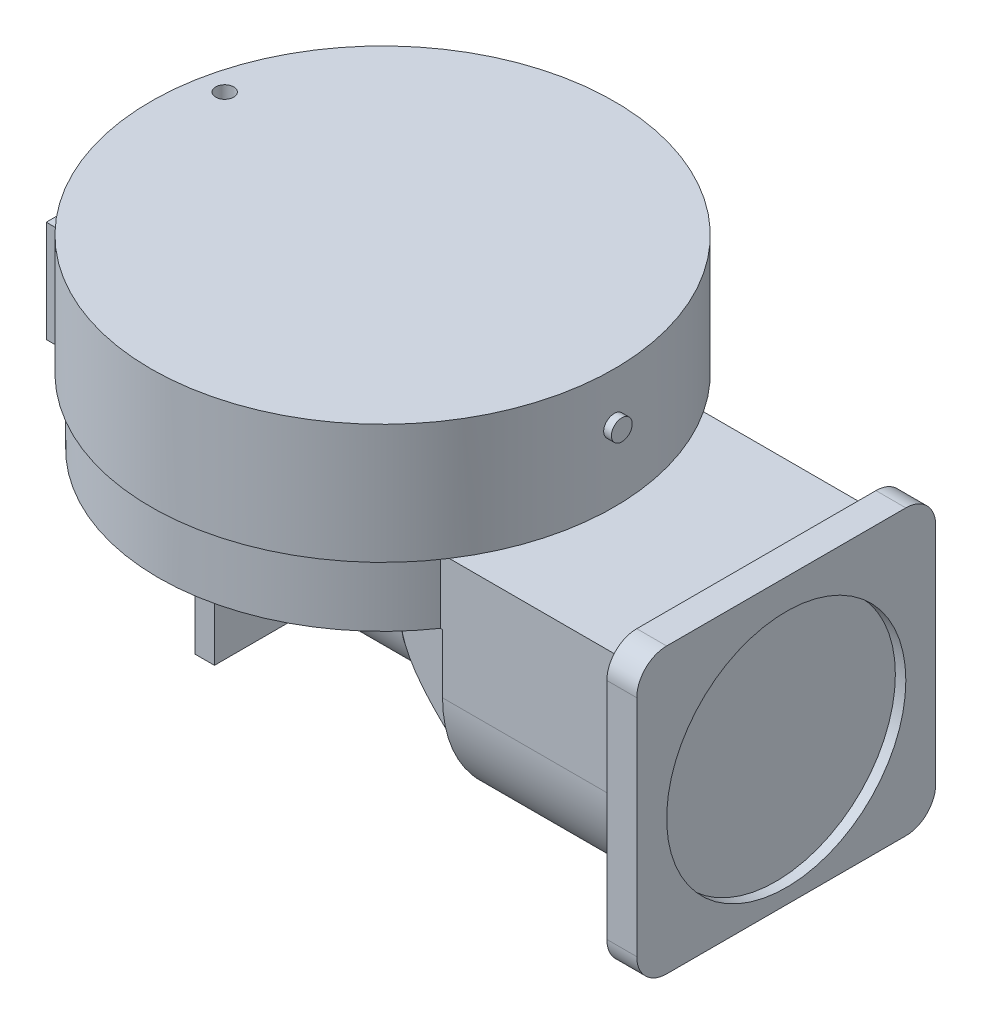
ISO-10303-21;
HEADER;
FILE_DESCRIPTION(('STEP AP214'),'2;1');
FILE_NAME('part.step','',(''),(''),'','','');
FILE_SCHEMA(('AUTOMOTIVE_DESIGN { 1 0 10303 214 1 1 1 1 }'));
ENDSEC;
DATA;
#1=APPLICATION_CONTEXT('core data for automotive mechanical design processes');
#2=APPLICATION_PROTOCOL_DEFINITION('international standard','automotive_design',2000,#1);
#3=PRODUCT_CONTEXT('',#1,'mechanical');
#4=PRODUCT('Part','Part','',(#3));
#5=PRODUCT_RELATED_PRODUCT_CATEGORY('part','',(#4));
#6=PRODUCT_DEFINITION_FORMATION('','',#4);
#7=PRODUCT_DEFINITION_CONTEXT('part definition',#1,'design');
#8=PRODUCT_DEFINITION('design','',#6,#7);
#9=PRODUCT_DEFINITION_SHAPE('','',#8);
#10=(LENGTH_UNIT() NAMED_UNIT(*) SI_UNIT(.MILLI.,.METRE.));
#11=(NAMED_UNIT(*) PLANE_ANGLE_UNIT() SI_UNIT($,.RADIAN.));
#12=(NAMED_UNIT(*) SI_UNIT($,.STERADIAN.) SOLID_ANGLE_UNIT());
#13=UNCERTAINTY_MEASURE_WITH_UNIT(LENGTH_MEASURE(1.E-05),#10,'distance_accuracy_value','');
#14=(GEOMETRIC_REPRESENTATION_CONTEXT(3) GLOBAL_UNCERTAINTY_ASSIGNED_CONTEXT((#13)) GLOBAL_UNIT_ASSIGNED_CONTEXT((#10,
#11,#12)) REPRESENTATION_CONTEXT('',''));
#15=CARTESIAN_POINT('',(0.,0.,0.));
#16=DIRECTION('',(0.,0.,1.));
#17=DIRECTION('',(1.,0.,0.));
#18=AXIS2_PLACEMENT_3D('',#15,#16,#17);
#19=CARTESIAN_POINT('',(-113.,130.223985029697,0.));
#20=DIRECTION('',(-1.,0.,0.));
#21=DIRECTION('',(0.,0.,1.));
#22=AXIS2_PLACEMENT_3D('',#19,#20,#21);
#23=CYLINDRICAL_SURFACE('',#22,6.97129008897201);
#24=CARTESIAN_POINT('',(-113.,130.223985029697,0.));
#25=DIRECTION('',(1.,0.,0.));
#26=DIRECTION('',(0.,0.,-1.));
#27=AXIS2_PLACEMENT_3D('',#24,#25,#26);
#28=CIRCLE('',#27,6.97129008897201);
#29=CARTESIAN_POINT('',(-113.,130.223985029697,-6.97129008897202));
#30=VERTEX_POINT('',#29);
#31=EDGE_CURVE('E28',#30,#30,#28,.T.);
#32=ORIENTED_EDGE('',*,*,#31,.F.);
#33=EDGE_LOOP('',(#32));
#34=FACE_BOUND('',#33,.T.);
#35=CARTESIAN_POINT('',(-118.156849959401,130.223985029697,6.971290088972));
#36=CARTESIAN_POINT('',(-118.156850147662,130.419739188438,6.97129159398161));
#37=CARTESIAN_POINT('',(-118.156477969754,130.615469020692,6.96304157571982));
#38=CARTESIAN_POINT('',(-118.155000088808,131.005601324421,6.93009981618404));
#39=CARTESIAN_POINT('',(-118.153894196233,131.200003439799,6.90540382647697));
#40=CARTESIAN_POINT('',(-118.150978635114,131.586199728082,6.83971196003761));
#41=CARTESIAN_POINT('',(-118.149168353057,131.777991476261,6.79870187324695));
#42=CARTESIAN_POINT('',(-118.144894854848,132.157502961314,6.70065795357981));
#43=CARTESIAN_POINT('',(-118.142431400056,132.345221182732,6.64361826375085));
#44=CARTESIAN_POINT('',(-118.136924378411,132.715015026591,6.51398573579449));
#45=CARTESIAN_POINT('',(-118.133881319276,132.897095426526,6.44140650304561));
#46=CARTESIAN_POINT('',(-118.127298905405,133.254559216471,6.28115315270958));
#47=CARTESIAN_POINT('',(-118.123759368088,133.429940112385,6.19347347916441));
#48=CARTESIAN_POINT('',(-118.116287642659,133.772585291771,6.00371980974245));
#49=CARTESIAN_POINT('',(-118.112355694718,133.9398544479,5.90165460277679));
#50=CARTESIAN_POINT('',(-118.104207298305,134.265266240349,5.68377401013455));
#51=CARTESIAN_POINT('',(-118.099990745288,134.423405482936,5.56795355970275));
#52=CARTESIAN_POINT('',(-118.091392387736,134.729426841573,5.32336936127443));
#53=CARTESIAN_POINT('',(-118.087010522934,134.877305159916,5.1946008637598));
#54=CARTESIAN_POINT('',(-118.078205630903,135.161745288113,4.92501963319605));
#55=CARTESIAN_POINT('',(-118.07378258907,135.298302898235,4.78420246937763));
#56=CARTESIAN_POINT('',(-118.065023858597,135.559028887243,4.49161180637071));
#57=CARTESIAN_POINT('',(-118.060688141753,135.683201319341,4.33984191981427));
#58=CARTESIAN_POINT('',(-118.05222389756,135.918370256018,4.0263229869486));
#59=CARTESIAN_POINT('',(-118.048095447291,136.029361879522,3.86457027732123));
#60=CARTESIAN_POINT('',(-118.040164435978,136.237330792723,3.53227620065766));
#61=CARTESIAN_POINT('',(-118.036361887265,136.334307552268,3.36173450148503));
#62=CARTESIAN_POINT('',(-118.029189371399,136.51358422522,3.01301909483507));
#63=CARTESIAN_POINT('',(-118.025819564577,136.595878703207,2.83484259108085));
#64=CARTESIAN_POINT('',(-118.019611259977,136.745131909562,2.4722326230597));
#65=CARTESIAN_POINT('',(-118.016772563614,136.812096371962,2.28780152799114));
#66=CARTESIAN_POINT('',(-118.011703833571,136.930270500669,1.91393090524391));
#67=CARTESIAN_POINT('',(-118.009474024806,136.981474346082,1.7244895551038));
#68=CARTESIAN_POINT('',(-118.003805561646,137.110712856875,1.15105841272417));
#69=CARTESIAN_POINT('',(-118.001376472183,137.164639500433,0.761315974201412));
#70=CARTESIAN_POINT('',(-117.999506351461,137.206268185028,-0.0214849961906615));
#71=CARTESIAN_POINT('',(-118.000065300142,137.193970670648,-0.414543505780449));
#72=CARTESIAN_POINT('',(-118.00410163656,137.103622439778,-1.19277836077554));
#73=CARTESIAN_POINT('',(-118.007576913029,137.025619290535,-1.57796020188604));
#74=CARTESIAN_POINT('',(-118.01705331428,136.80612481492,-2.32974171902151));
#75=CARTESIAN_POINT('',(-118.02305444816,136.664633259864,-2.69634132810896));
#76=CARTESIAN_POINT('',(-118.036909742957,136.322130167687,-3.40072377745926));
#77=CARTESIAN_POINT('',(-118.044764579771,136.121096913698,-3.73849604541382));
#78=CARTESIAN_POINT('',(-118.061442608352,135.665231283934,-4.37551509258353));
#79=CARTESIAN_POINT('',(-118.070265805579,135.410398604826,-4.6747616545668));
#80=CARTESIAN_POINT('',(-118.087895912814,134.853899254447,-5.22651354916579));
#81=CARTESIAN_POINT('',(-118.096702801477,134.552191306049,-5.47897725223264));
#82=CARTESIAN_POINT('',(-118.113299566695,133.910650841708,-5.92967592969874));
#83=CARTESIAN_POINT('',(-118.121089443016,133.570818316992,-6.12791089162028));
#84=CARTESIAN_POINT('',(-118.134773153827,132.862650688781,-6.46452113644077));
#85=CARTESIAN_POINT('',(-118.14066694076,132.494314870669,-6.60289491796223));
#86=CARTESIAN_POINT('',(-118.149891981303,131.739607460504,-6.81582735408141));
#87=CARTESIAN_POINT('',(-118.153223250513,131.353235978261,-6.89038639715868));
#88=CARTESIAN_POINT('',(-118.15694472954,130.573787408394,-6.97352154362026));
#89=CARTESIAN_POINT('',(-118.157337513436,130.180716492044,-6.98215539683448));
#90=CARTESIAN_POINT('',(-118.155144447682,129.39870831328,-6.93334571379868));
#91=CARTESIAN_POINT('',(-118.152558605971,129.009771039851,-6.87590235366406));
#92=CARTESIAN_POINT('',(-118.144702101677,128.247232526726,-6.69661675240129));
#93=CARTESIAN_POINT('',(-118.139432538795,127.873625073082,-6.57480088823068));
#94=CARTESIAN_POINT('',(-118.126803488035,127.152160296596,-6.27025478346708));
#95=CARTESIAN_POINT('',(-118.119443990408,126.804303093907,-6.08752425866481));
#96=CARTESIAN_POINT('',(-118.103458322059,126.143947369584,-5.66618783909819));
#97=CARTESIAN_POINT('',(-118.094831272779,125.831473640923,-5.42754312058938));
#98=CARTESIAN_POINT('',(-118.077286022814,125.251004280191,-4.90120796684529));
#99=CARTESIAN_POINT('',(-118.068367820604,124.983008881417,-4.6135172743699));
#100=CARTESIAN_POINT('',(-118.051237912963,124.498909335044,-3.9970140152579));
#101=CARTESIAN_POINT('',(-118.043026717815,124.282842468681,-3.6681721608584));
#102=CARTESIAN_POINT('',(-118.02824379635,123.908990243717,-2.97883012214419));
#103=CARTESIAN_POINT('',(-118.021672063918,123.751204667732,-2.61833005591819));
#104=CARTESIAN_POINT('',(-118.010910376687,123.498451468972,-1.87611669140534));
#105=CARTESIAN_POINT('',(-118.006719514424,123.403459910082,-1.49441153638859));
#106=CARTESIAN_POINT('',(-118.00119134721,123.278941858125,-0.720237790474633));
#107=CARTESIAN_POINT('',(-117.999854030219,123.249415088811,-0.32776924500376));
#108=CARTESIAN_POINT('',(-118.000092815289,123.25477578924,0.259911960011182));
#109=CARTESIAN_POINT('',(-118.00054668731,123.264841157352,0.455654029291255));
#110=CARTESIAN_POINT('',(-118.002184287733,123.301401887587,0.845575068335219));
#111=CARTESIAN_POINT('',(-118.003367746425,123.327891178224,1.03975458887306));
#112=CARTESIAN_POINT('',(-118.006432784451,123.397130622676,1.42524706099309));
#113=CARTESIAN_POINT('',(-118.008314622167,123.439886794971,1.61655892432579));
#114=CARTESIAN_POINT('',(-118.012721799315,123.541331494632,1.99483122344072));
#115=CARTESIAN_POINT('',(-118.015246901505,123.600014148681,2.18179323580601));
#116=CARTESIAN_POINT('',(-118.020870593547,123.732926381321,2.55017701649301));
#117=CARTESIAN_POINT('',(-118.023969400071,123.807161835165,2.73159666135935));
#118=CARTESIAN_POINT('',(-118.03065079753,123.970606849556,3.08747020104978));
#119=CARTESIAN_POINT('',(-118.034233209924,124.059810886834,3.26192663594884));
#120=CARTESIAN_POINT('',(-118.041782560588,124.252610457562,3.60276559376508));
#121=CARTESIAN_POINT('',(-118.045749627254,124.356210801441,3.76914539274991));
#122=CARTESIAN_POINT('',(-118.053953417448,124.577003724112,4.09253044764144));
#123=CARTESIAN_POINT('',(-118.058190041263,124.694191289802,4.24953912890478));
#124=CARTESIAN_POINT('',(-118.066819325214,124.941500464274,4.5533115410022));
#125=CARTESIAN_POINT('',(-118.071212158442,125.071636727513,4.70006333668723));
#126=CARTESIAN_POINT('',(-118.08002305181,125.34375720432,4.98203138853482));
#127=CARTESIAN_POINT('',(-118.084441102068,125.485737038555,5.11725187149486));
#128=CARTESIAN_POINT('',(-118.093181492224,125.780670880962,5.37533878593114));
#129=CARTESIAN_POINT('',(-118.097503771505,125.933631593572,5.49819755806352));
#130=CARTESIAN_POINT('',(-118.105925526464,126.249306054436,5.73055042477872));
#131=CARTESIAN_POINT('',(-118.11002508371,126.41201618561,5.84004943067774));
#132=CARTESIAN_POINT('',(-118.117891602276,126.746293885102,6.04508411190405));
#133=CARTESIAN_POINT('',(-118.121658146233,126.917872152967,6.14060236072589));
#134=CARTESIAN_POINT('',(-118.128744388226,127.268415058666,6.31679985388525));
#135=CARTESIAN_POINT('',(-118.132064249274,127.447376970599,6.39748451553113));
#136=CARTESIAN_POINT('',(-118.138161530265,127.811317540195,6.54341813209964));
#137=CARTESIAN_POINT('',(-118.140939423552,127.996290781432,6.60868056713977));
#138=CARTESIAN_POINT('',(-118.145876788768,128.371023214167,6.72337809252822));
#139=CARTESIAN_POINT('',(-118.148036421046,128.560781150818,6.77281728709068));
#140=CARTESIAN_POINT('',(-118.152151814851,128.99384836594,6.86634430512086));
#141=CARTESIAN_POINT('',(-118.15390712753,129.23820386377,6.90566471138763));
#142=CARTESIAN_POINT('',(-118.156256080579,129.729714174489,6.95813664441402));
#143=CARTESIAN_POINT('',(-118.156849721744,129.976868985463,6.97128818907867));
#144=CARTESIAN_POINT('',(-118.156849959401,130.223985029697,6.971290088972));
#145=B_SPLINE_CURVE_WITH_KNOTS('',3,(#35,#36,#37,#38,#39,#40,#41,#42,#43,#44,#45,#46,#47,#48,
#49,#50,#51,#52,#53,#54,#55,#56,#57,#58,#59,#60,#61,#62,#63,#64,#65,#66,#67,#68,#69,#70,#71,#72,
#73,#74,#75,#76,#77,#78,#79,#80,#81,#82,#83,#84,#85,#86,#87,#88,#89,#90,#91,#92,#93,#94,#95,#96,
#97,#98,#99,#100,#101,#102,#103,#104,#105,#106,#107,#108,#109,#110,#111,#112,#113,#114,#115,
#116,#117,#118,#119,#120,#121,#122,#123,#124,#125,#126,#127,#128,#129,#130,#131,#132,#133,#134,
#135,#136,#137,#138,#139,#140,#141,#142,#143,#144),.UNSPECIFIED.,.T.,.F.,(4,2,2,2,2,2,2,2,2,2,2,
2,2,2,2,2,2,2,2,2,2,2,2,2,2,2,2,2,2,2,2,2,2,2,2,2,2,2,2,2,2,2,2,2,2,2,2,2,2,2,2,2,2,2,4),(0.,
0.587046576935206,1.17424486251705,1.76195573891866,2.34988163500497,2.93729487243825,
3.52492470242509,4.11219706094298,4.6996863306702,5.28739189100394,5.875314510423,
6.46304408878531,7.05099063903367,7.63895942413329,8.22714542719,8.81511106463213,
9.40329359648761,10.5775913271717,11.7518811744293,12.9253216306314,14.0987663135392,
15.2726395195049,16.4465193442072,17.6214387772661,18.7963584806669,19.9713076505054,
21.1462496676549,22.3201623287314,23.4940718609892,24.6675007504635,25.8409351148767,
27.0151866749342,28.1894443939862,29.3645426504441,30.539636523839,31.7142822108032,
32.8889229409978,33.476355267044,34.0635705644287,34.6510033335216,35.2382197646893,
35.8256584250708,36.4128808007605,37.0002998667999,37.5875028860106,38.1753781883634,
38.7630370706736,39.3510578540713,39.9388618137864,40.5273923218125,41.1157074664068,
41.7035064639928,42.2911528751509,43.0322289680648,43.7733045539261),.UNSPECIFIED.);
#146=CARTESIAN_POINT('',(-118.156849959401,130.223985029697,6.971290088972));
#147=VERTEX_POINT('',#146);
#148=EDGE_CURVE('E11',#147,#147,#145,.T.);
#149=ORIENTED_EDGE('',*,*,#148,.F.);
#150=EDGE_LOOP('',(#149));
#151=FACE_BOUND('',#150,.T.);
#152=ADVANCED_FACE('F17',(#34,#151),#23,.T.);
#153=CARTESIAN_POINT('',(-113.,130.223985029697,0.));
#154=DIRECTION('',(1.,0.,0.));
#155=DIRECTION('',(0.,0.,-1.));
#156=AXIS2_PLACEMENT_3D('',#153,#154,#155);
#157=PLANE('',#156);
#158=ORIENTED_EDGE('',*,*,#31,.T.);
#159=EDGE_LOOP('',(#158));
#160=FACE_BOUND('',#159,.T.);
#161=ADVANCED_FACE('F447',(#160),#157,.T.);
#162=CARTESIAN_POINT('',(-273.,163.,1.11022302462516E-13));
#163=DIRECTION('',(0.,-1.,0.));
#164=DIRECTION('',(0.,0.,-1.));
#165=AXIS2_PLACEMENT_3D('',#162,#163,#164);
#166=CYLINDRICAL_SURFACE('',#165,155.);
#167=CARTESIAN_POINT('',(-273.,83.,1.11022302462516E-13));
#168=DIRECTION('',(0.,1.,0.));
#169=DIRECTION('',(0.,0.,1.));
#170=AXIS2_PLACEMENT_3D('',#167,#168,#169);
#171=CIRCLE('',#170,155.);
#172=CARTESIAN_POINT('',(-143.385186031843,83.,85.));
#173=VERTEX_POINT('',#172);
#174=CARTESIAN_POINT('',(-143.385186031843,83.,-85.));
#175=VERTEX_POINT('',#174);
#176=EDGE_CURVE('E250',#173,#175,#171,.T.);
#177=ORIENTED_EDGE('',*,*,#176,.T.);
#178=CARTESIAN_POINT('',(-425.970585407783,83.,-25.));
#179=VERTEX_POINT('',#178);
#180=EDGE_CURVE('E264',#175,#179,#171,.T.);
#181=ORIENTED_EDGE('',*,*,#180,.T.);
#182=CARTESIAN_POINT('',(-425.970585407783,83.,25.));
#183=VERTEX_POINT('',#182);
#184=EDGE_CURVE('E253',#179,#183,#171,.T.);
#185=ORIENTED_EDGE('',*,*,#184,.T.);
#186=EDGE_CURVE('E233',#183,#173,#171,.T.);
#187=ORIENTED_EDGE('',*,*,#186,.T.);
#188=EDGE_LOOP('',(#177,#181,#185,#187));
#189=FACE_BOUND('',#188,.T.);
#190=CARTESIAN_POINT('',(-273.,163.,1.11022302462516E-13));
#191=DIRECTION('',(0.,1.,0.));
#192=DIRECTION('',(0.,0.,1.));
#193=AXIS2_PLACEMENT_3D('',#190,#191,#192);
#194=CIRCLE('',#193,155.);
#195=CARTESIAN_POINT('',(-273.,163.,155.));
#196=VERTEX_POINT('',#195);
#197=EDGE_CURVE('E263',#196,#196,#194,.T.);
#198=ORIENTED_EDGE('',*,*,#197,.F.);
#199=EDGE_LOOP('',(#198));
#200=FACE_BOUND('',#199,.T.);
#201=ORIENTED_EDGE('',*,*,#148,.T.);
#202=EDGE_LOOP('',(#201));
#203=FACE_BOUND('',#202,.T.);
#204=ADVANCED_FACE('F247',(#189,#200,#203),#166,.T.);
#205=CARTESIAN_POINT('',(-473.,0.,52.5));
#206=DIRECTION('',(-1.,0.,0.));
#207=DIRECTION('',(0.,0.,1.));
#208=AXIS2_PLACEMENT_3D('',#205,#206,#207);
#209=PLANE('',#208);
#210=DIRECTION('',(0.,1.,0.));
#211=VECTOR('',#210,1.);
#212=CARTESIAN_POINT('',(-473.,-90.,-25.));
#213=LINE('',#212,#211);
#214=CARTESIAN_POINT('',(-473.,15.,-25.));
#215=VERTEX_POINT('',#214);
#216=CARTESIAN_POINT('',(-473.,83.,-25.));
#217=VERTEX_POINT('',#216);
#218=EDGE_CURVE('E570',#215,#217,#213,.T.);
#219=ORIENTED_EDGE('',*,*,#218,.F.);
#220=DIRECTION('',(0.,0.,-1.));
#221=VECTOR('',#220,1.);
#222=CARTESIAN_POINT('',(-473.,15.,52.5));
#223=LINE('',#222,#221);
#224=CARTESIAN_POINT('',(-473.,15.,25.));
#225=VERTEX_POINT('',#224);
#226=EDGE_CURVE('E581',#225,#215,#223,.T.);
#227=ORIENTED_EDGE('',*,*,#226,.F.);
#228=DIRECTION('',(0.,1.,0.));
#229=VECTOR('',#228,1.);
#230=CARTESIAN_POINT('',(-473.,-90.,25.));
#231=LINE('',#230,#229);
#232=CARTESIAN_POINT('',(-473.,83.,25.));
#233=VERTEX_POINT('',#232);
#234=EDGE_CURVE('E578',#225,#233,#231,.T.);
#235=ORIENTED_EDGE('',*,*,#234,.T.);
#236=DIRECTION('',(0.,0.,-1.));
#237=VECTOR('',#236,1.);
#238=CARTESIAN_POINT('',(-473.,83.,-52.5));
#239=LINE('',#238,#237);
#240=EDGE_CURVE('E588',#233,#217,#239,.T.);
#241=ORIENTED_EDGE('',*,*,#240,.T.);
#242=EDGE_LOOP('',(#219,#227,#235,#241));
#243=FACE_BOUND('',#242,.T.);
#244=CARTESIAN_POINT('',(-473.,49.8968622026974,0.));
#245=DIRECTION('',(-1.,0.,0.));
#246=DIRECTION('',(0.,0.,1.));
#247=AXIS2_PLACEMENT_3D('',#244,#245,#246);
#248=CIRCLE('',#247,6.79277520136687);
#249=CARTESIAN_POINT('',(-473.,49.8968622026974,6.79277520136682));
#250=VERTEX_POINT('',#249);
#251=EDGE_CURVE('E1007',#250,#250,#248,.T.);
#252=ORIENTED_EDGE('',*,*,#251,.F.);
#253=EDGE_LOOP('',(#252));
#254=FACE_BOUND('',#253,.T.);
#255=ADVANCED_FACE('F332',(#243,#254),#209,.T.);
#256=CARTESIAN_POINT('',(-273.,83.,85.));
#257=DIRECTION('',(0.,-1.,0.));
#258=DIRECTION('',(0.,0.,-1.));
#259=AXIS2_PLACEMENT_3D('',#256,#257,#258);
#260=PLANE('',#259);
#261=ORIENTED_EDGE('',*,*,#184,.F.);
#262=DIRECTION('',(1.,0.,0.));
#263=VECTOR('',#262,1.);
#264=CARTESIAN_POINT('',(-473.,83.,-25.));
#265=LINE('',#264,#263);
#266=EDGE_CURVE('E573',#217,#179,#265,.T.);
#267=ORIENTED_EDGE('',*,*,#266,.F.);
#268=ORIENTED_EDGE('',*,*,#240,.F.);
#269=DIRECTION('',(-1.,0.,0.));
#270=VECTOR('',#269,1.);
#271=CARTESIAN_POINT('',(-473.,83.,25.));
#272=LINE('',#271,#270);
#273=EDGE_CURVE('E565',#183,#233,#272,.T.);
#274=ORIENTED_EDGE('',*,*,#273,.F.);
#275=EDGE_LOOP('',(#261,#267,#268,#274));
#276=FACE_BOUND('',#275,.T.);
#277=ADVANCED_FACE('F334',(#276),#260,.F.);
#278=ORIENTED_EDGE('',*,*,#176,.F.);
#279=DIRECTION('',(1.,0.,0.));
#280=VECTOR('',#279,1.);
#281=CARTESIAN_POINT('',(-273.,83.,85.));
#282=LINE('',#281,#280);
#283=CARTESIAN_POINT('',(-23.,83.,85.));
#284=VERTEX_POINT('',#283);
#285=EDGE_CURVE('E242',#173,#284,#282,.T.);
#286=ORIENTED_EDGE('',*,*,#285,.T.);
#287=DIRECTION('',(0.,0.,-1.));
#288=VECTOR('',#287,1.);
#289=CARTESIAN_POINT('',(-23.,83.,85.));
#290=LINE('',#289,#288);
#291=CARTESIAN_POINT('',(-23.,83.,-85.));
#292=VERTEX_POINT('',#291);
#293=EDGE_CURVE('E625',#284,#292,#290,.T.);
#294=ORIENTED_EDGE('',*,*,#293,.T.);
#295=DIRECTION('',(1.,0.,0.));
#296=VECTOR('',#295,1.);
#297=CARTESIAN_POINT('',(-273.,83.,-85.));
#298=LINE('',#297,#296);
#299=EDGE_CURVE('E261',#175,#292,#298,.T.);
#300=ORIENTED_EDGE('',*,*,#299,.F.);
#301=EDGE_LOOP('',(#278,#286,#294,#300));
#302=FACE_BOUND('',#301,.T.);
#303=ADVANCED_FACE('F258',(#302),#260,.F.);
#304=CARTESIAN_POINT('',(-23.,100.,100.));
#305=DIRECTION('',(0.,0.,1.));
#306=DIRECTION('',(0.,-1.,0.));
#307=AXIS2_PLACEMENT_3D('',#304,#305,#306);
#308=PLANE('',#307);
#309=DIRECTION('',(1.,0.,0.));
#310=VECTOR('',#309,1.);
#311=CARTESIAN_POINT('',(-23.,-70.,100.));
#312=LINE('',#311,#310);
#313=CARTESIAN_POINT('',(-23.,-70.,100.));
#314=VERTEX_POINT('',#313);
#315=CARTESIAN_POINT('',(-3.00000000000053,-70.,100.));
#316=VERTEX_POINT('',#315);
#317=EDGE_CURVE('E694',#314,#316,#312,.T.);
#318=ORIENTED_EDGE('',*,*,#317,.T.);
#319=DIRECTION('',(0.,1.,0.));
#320=VECTOR('',#319,1.);
#321=CARTESIAN_POINT('',(-3.00000000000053,100.,100.));
#322=LINE('',#321,#320);
#323=CARTESIAN_POINT('',(-3.00000000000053,80.,100.));
#324=VERTEX_POINT('',#323);
#325=EDGE_CURVE('E652',#316,#324,#322,.T.);
#326=ORIENTED_EDGE('',*,*,#325,.T.);
#327=DIRECTION('',(1.,0.,0.));
#328=VECTOR('',#327,1.);
#329=CARTESIAN_POINT('',(-23.,80.,100.));
#330=LINE('',#329,#328);
#331=CARTESIAN_POINT('',(-23.,80.,100.));
#332=VERTEX_POINT('',#331);
#333=EDGE_CURVE('E692',#324,#332,#330,.F.);
#334=ORIENTED_EDGE('',*,*,#333,.T.);
#335=DIRECTION('',(0.,-1.,0.));
#336=VECTOR('',#335,1.);
#337=CARTESIAN_POINT('',(-23.,100.,100.));
#338=LINE('',#337,#336);
#339=EDGE_CURVE('E278',#332,#314,#338,.T.);
#340=ORIENTED_EDGE('',*,*,#339,.T.);
#341=EDGE_LOOP('',(#318,#326,#334,#340));
#342=FACE_BOUND('',#341,.T.);
#343=ADVANCED_FACE('F903',(#342),#308,.T.);
#344=CARTESIAN_POINT('',(-23.,100.,100.));
#345=DIRECTION('',(0.,1.,0.));
#346=DIRECTION('',(0.,0.,1.));
#347=AXIS2_PLACEMENT_3D('',#344,#345,#346);
#348=PLANE('',#347);
#349=DIRECTION('',(1.,0.,0.));
#350=VECTOR('',#349,1.);
#351=CARTESIAN_POINT('',(-23.,100.,80.));
#352=LINE('',#351,#350);
#353=CARTESIAN_POINT('',(-23.,100.,80.));
#354=VERTEX_POINT('',#353);
#355=CARTESIAN_POINT('',(-3.,100.,80.));
#356=VERTEX_POINT('',#355);
#357=EDGE_CURVE('E687',#354,#356,#352,.T.);
#358=ORIENTED_EDGE('',*,*,#357,.T.);
#359=DIRECTION('',(0.,0.,-1.));
#360=VECTOR('',#359,1.);
#361=CARTESIAN_POINT('',(-3.00000000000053,100.,100.));
#362=LINE('',#361,#360);
#363=CARTESIAN_POINT('',(-3.,100.,-80.));
#364=VERTEX_POINT('',#363);
#365=EDGE_CURVE('E35',#356,#364,#362,.T.);
#366=ORIENTED_EDGE('',*,*,#365,.T.);
#367=DIRECTION('',(1.,0.,0.));
#368=VECTOR('',#367,1.);
#369=CARTESIAN_POINT('',(-23.,100.,-80.));
#370=LINE('',#369,#368);
#371=CARTESIAN_POINT('',(-23.,100.,-80.));
#372=VERTEX_POINT('',#371);
#373=EDGE_CURVE('E690',#364,#372,#370,.F.);
#374=ORIENTED_EDGE('',*,*,#373,.T.);
#375=DIRECTION('',(0.,0.,1.));
#376=VECTOR('',#375,1.);
#377=CARTESIAN_POINT('',(-23.,100.,100.));
#378=LINE('',#377,#376);
#379=EDGE_CURVE('E287',#372,#354,#378,.T.);
#380=ORIENTED_EDGE('',*,*,#379,.T.);
#381=EDGE_LOOP('',(#358,#366,#374,#380));
#382=FACE_BOUND('',#381,.T.);
#383=ADVANCED_FACE('F701',(#382),#348,.T.);
#384=CARTESIAN_POINT('',(-23.,100.,-100.));
#385=DIRECTION('',(0.,0.,-1.));
#386=DIRECTION('',(0.,1.,0.));
#387=AXIS2_PLACEMENT_3D('',#384,#385,#386);
#388=PLANE('',#387);
#389=DIRECTION('',(1.,0.,0.));
#390=VECTOR('',#389,1.);
#391=CARTESIAN_POINT('',(-23.,80.,-100.));
#392=LINE('',#391,#390);
#393=CARTESIAN_POINT('',(-23.,80.,-100.));
#394=VERTEX_POINT('',#393);
#395=CARTESIAN_POINT('',(-2.99999999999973,80.,-100.));
#396=VERTEX_POINT('',#395);
#397=EDGE_CURVE('E671',#394,#396,#392,.T.);
#398=ORIENTED_EDGE('',*,*,#397,.T.);
#399=DIRECTION('',(0.,-1.,0.));
#400=VECTOR('',#399,1.);
#401=CARTESIAN_POINT('',(-2.99999999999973,100.,-100.));
#402=LINE('',#401,#400);
#403=CARTESIAN_POINT('',(-2.99999999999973,-70.,-100.));
#404=VERTEX_POINT('',#403);
#405=EDGE_CURVE('E513',#396,#404,#402,.T.);
#406=ORIENTED_EDGE('',*,*,#405,.T.);
#407=DIRECTION('',(1.,0.,0.));
#408=VECTOR('',#407,1.);
#409=CARTESIAN_POINT('',(-23.,-70.,-100.));
#410=LINE('',#409,#408);
#411=CARTESIAN_POINT('',(-23.,-70.,-100.));
#412=VERTEX_POINT('',#411);
#413=EDGE_CURVE('E668',#404,#412,#410,.F.);
#414=ORIENTED_EDGE('',*,*,#413,.T.);
#415=DIRECTION('',(0.,1.,0.));
#416=VECTOR('',#415,1.);
#417=CARTESIAN_POINT('',(-23.,100.,-100.));
#418=LINE('',#417,#416);
#419=EDGE_CURVE('E284',#412,#394,#418,.T.);
#420=ORIENTED_EDGE('',*,*,#419,.T.);
#421=EDGE_LOOP('',(#398,#406,#414,#420));
#422=FACE_BOUND('',#421,.T.);
#423=ADVANCED_FACE('F667',(#422),#388,.T.);
#424=CARTESIAN_POINT('',(-23.,-90.,100.));
#425=DIRECTION('',(0.,-1.,0.));
#426=DIRECTION('',(0.,0.,-1.));
#427=AXIS2_PLACEMENT_3D('',#424,#425,#426);
#428=PLANE('',#427);
#429=DIRECTION('',(1.,0.,0.));
#430=VECTOR('',#429,1.);
#431=CARTESIAN_POINT('',(-23.,-90.,-80.));
#432=LINE('',#431,#430);
#433=CARTESIAN_POINT('',(-23.,-90.,-80.));
#434=VERTEX_POINT('',#433);
#435=CARTESIAN_POINT('',(-3.,-90.,-80.));
#436=VERTEX_POINT('',#435);
#437=EDGE_CURVE('E679',#434,#436,#432,.T.);
#438=ORIENTED_EDGE('',*,*,#437,.T.);
#439=DIRECTION('',(0.,0.,1.));
#440=VECTOR('',#439,1.);
#441=CARTESIAN_POINT('',(-3.00000000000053,-90.,100.));
#442=LINE('',#441,#440);
#443=CARTESIAN_POINT('',(-3.,-90.,80.));
#444=VERTEX_POINT('',#443);
#445=EDGE_CURVE('E661',#436,#444,#442,.T.);
#446=ORIENTED_EDGE('',*,*,#445,.T.);
#447=DIRECTION('',(1.,0.,0.));
#448=VECTOR('',#447,1.);
#449=CARTESIAN_POINT('',(-23.,-90.,80.));
#450=LINE('',#449,#448);
#451=CARTESIAN_POINT('',(-23.,-90.,80.));
#452=VERTEX_POINT('',#451);
#453=EDGE_CURVE('E708',#444,#452,#450,.F.);
#454=ORIENTED_EDGE('',*,*,#453,.T.);
#455=DIRECTION('',(0.,0.,-1.));
#456=VECTOR('',#455,1.);
#457=CARTESIAN_POINT('',(-23.,-90.,100.));
#458=LINE('',#457,#456);
#459=EDGE_CURVE('E281',#452,#434,#458,.T.);
#460=ORIENTED_EDGE('',*,*,#459,.T.);
#461=EDGE_LOOP('',(#438,#446,#454,#460));
#462=FACE_BOUND('',#461,.T.);
#463=ADVANCED_FACE('F492',(#462),#428,.T.);
#464=CARTESIAN_POINT('',(-23.,-70.,-80.));
#465=DIRECTION('',(1.,0.,0.));
#466=DIRECTION('',(0.,0.,-1.));
#467=AXIS2_PLACEMENT_3D('',#464,#465,#466);
#468=CYLINDRICAL_SURFACE('',#467,20.);
#469=ORIENTED_EDGE('',*,*,#413,.F.);
#470=CARTESIAN_POINT('',(-3.,-70.,-80.));
#471=DIRECTION('',(1.,0.,0.));
#472=DIRECTION('',(0.,0.,-1.));
#473=AXIS2_PLACEMENT_3D('',#470,#471,#472);
#474=CIRCLE('',#473,20.);
#475=EDGE_CURVE('E508',#404,#436,#474,.F.);
#476=ORIENTED_EDGE('',*,*,#475,.T.);
#477=ORIENTED_EDGE('',*,*,#437,.F.);
#478=CARTESIAN_POINT('',(-23.,-70.,-80.));
#479=DIRECTION('',(1.,0.,0.));
#480=DIRECTION('',(0.,0.,-1.));
#481=AXIS2_PLACEMENT_3D('',#478,#479,#480);
#482=CIRCLE('',#481,20.);
#483=EDGE_CURVE('E675',#412,#434,#482,.F.);
#484=ORIENTED_EDGE('',*,*,#483,.F.);
#485=EDGE_LOOP('',(#469,#476,#477,#484));
#486=FACE_BOUND('',#485,.T.);
#487=ADVANCED_FACE('F489',(#486),#468,.T.);
#488=CARTESIAN_POINT('',(-23.,80.,-80.));
#489=DIRECTION('',(1.,0.,0.));
#490=DIRECTION('',(0.,0.,-1.));
#491=AXIS2_PLACEMENT_3D('',#488,#489,#490);
#492=CYLINDRICAL_SURFACE('',#491,20.);
#493=ORIENTED_EDGE('',*,*,#373,.F.);
#494=CARTESIAN_POINT('',(-3.,80.,-80.));
#495=DIRECTION('',(1.,0.,0.));
#496=DIRECTION('',(0.,0.,-1.));
#497=AXIS2_PLACEMENT_3D('',#494,#495,#496);
#498=CIRCLE('',#497,20.);
#499=EDGE_CURVE('E658',#364,#396,#498,.F.);
#500=ORIENTED_EDGE('',*,*,#499,.T.);
#501=ORIENTED_EDGE('',*,*,#397,.F.);
#502=CARTESIAN_POINT('',(-23.,80.,-80.));
#503=DIRECTION('',(1.,0.,0.));
#504=DIRECTION('',(0.,0.,-1.));
#505=AXIS2_PLACEMENT_3D('',#502,#503,#504);
#506=CIRCLE('',#505,20.);
#507=EDGE_CURVE('E684',#372,#394,#506,.F.);
#508=ORIENTED_EDGE('',*,*,#507,.F.);
#509=EDGE_LOOP('',(#493,#500,#501,#508));
#510=FACE_BOUND('',#509,.T.);
#511=ADVANCED_FACE('F485',(#510),#492,.T.);
#512=CARTESIAN_POINT('',(-23.,-70.,80.));
#513=DIRECTION('',(1.,0.,0.));
#514=DIRECTION('',(0.,0.,-1.));
#515=AXIS2_PLACEMENT_3D('',#512,#513,#514);
#516=CYLINDRICAL_SURFACE('',#515,20.);
#517=ORIENTED_EDGE('',*,*,#453,.F.);
#518=CARTESIAN_POINT('',(-3.,-70.,80.));
#519=DIRECTION('',(1.,0.,0.));
#520=DIRECTION('',(0.,0.,-1.));
#521=AXIS2_PLACEMENT_3D('',#518,#519,#520);
#522=CIRCLE('',#521,20.);
#523=EDGE_CURVE('E655',#444,#316,#522,.F.);
#524=ORIENTED_EDGE('',*,*,#523,.T.);
#525=ORIENTED_EDGE('',*,*,#317,.F.);
#526=CARTESIAN_POINT('',(-23.,-70.,80.));
#527=DIRECTION('',(1.,0.,0.));
#528=DIRECTION('',(0.,0.,-1.));
#529=AXIS2_PLACEMENT_3D('',#526,#527,#528);
#530=CIRCLE('',#529,20.);
#531=EDGE_CURVE('E677',#452,#314,#530,.F.);
#532=ORIENTED_EDGE('',*,*,#531,.F.);
#533=EDGE_LOOP('',(#517,#524,#525,#532));
#534=FACE_BOUND('',#533,.T.);
#535=ADVANCED_FACE('F481',(#534),#516,.T.);
#536=CARTESIAN_POINT('',(-23.,80.,80.));
#537=DIRECTION('',(1.,0.,0.));
#538=DIRECTION('',(0.,0.,-1.));
#539=AXIS2_PLACEMENT_3D('',#536,#537,#538);
#540=CYLINDRICAL_SURFACE('',#539,20.);
#541=ORIENTED_EDGE('',*,*,#333,.F.);
#542=CARTESIAN_POINT('',(-3.,80.,80.));
#543=DIRECTION('',(1.,0.,0.));
#544=DIRECTION('',(0.,0.,-1.));
#545=AXIS2_PLACEMENT_3D('',#542,#543,#544);
#546=CIRCLE('',#545,20.);
#547=EDGE_CURVE('E697',#324,#356,#546,.F.);
#548=ORIENTED_EDGE('',*,*,#547,.T.);
#549=ORIENTED_EDGE('',*,*,#357,.F.);
#550=CARTESIAN_POINT('',(-23.,80.,80.));
#551=DIRECTION('',(1.,0.,0.));
#552=DIRECTION('',(0.,0.,-1.));
#553=AXIS2_PLACEMENT_3D('',#550,#551,#552);
#554=CIRCLE('',#553,20.);
#555=EDGE_CURVE('E43',#332,#354,#554,.F.);
#556=ORIENTED_EDGE('',*,*,#555,.F.);
#557=EDGE_LOOP('',(#541,#548,#549,#556));
#558=FACE_BOUND('',#557,.T.);
#559=ADVANCED_FACE('F352',(#558),#540,.T.);
#560=CARTESIAN_POINT('',(-273.,39.5,1.11022302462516E-13));
#561=DIRECTION('',(0.,1.,0.));
#562=DIRECTION('',(0.,0.,1.));
#563=AXIS2_PLACEMENT_3D('',#560,#561,#562);
#564=CYLINDRICAL_SURFACE('',#563,150.);
#565=CARTESIAN_POINT('',(-273.,39.5,1.11022302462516E-13));
#566=DIRECTION('',(0.,1.,0.));
#567=DIRECTION('',(0.,0.,1.));
#568=AXIS2_PLACEMENT_3D('',#565,#566,#567);
#569=CIRCLE('',#568,150.);
#570=CARTESIAN_POINT('',(-149.407929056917,39.5,-85.));
#571=VERTEX_POINT('',#570);
#572=CARTESIAN_POINT('',(-413.512454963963,39.5,-52.5));
#573=VERTEX_POINT('',#572);
#574=EDGE_CURVE('E564',#571,#573,#569,.T.);
#575=ORIENTED_EDGE('',*,*,#574,.T.);
#576=DIRECTION('',(0.,1.,0.));
#577=VECTOR('',#576,1.);
#578=CARTESIAN_POINT('',(-413.512454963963,-90.,-52.5));
#579=LINE('',#578,#577);
#580=CARTESIAN_POINT('',(-413.512454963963,15.,-52.5));
#581=VERTEX_POINT('',#580);
#582=EDGE_CURVE('E557',#581,#573,#579,.T.);
#583=ORIENTED_EDGE('',*,*,#582,.F.);
#584=CARTESIAN_POINT('',(-273.,15.,1.11022302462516E-13));
#585=DIRECTION('',(0.,-1.,0.));
#586=DIRECTION('',(0.,0.,-1.));
#587=AXIS2_PLACEMENT_3D('',#584,#585,#586);
#588=CIRCLE('',#587,150.);
#589=CARTESIAN_POINT('',(-420.90199457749,15.,-24.9999999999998));
#590=VERTEX_POINT('',#589);
#591=EDGE_CURVE('E298',#581,#590,#588,.F.);
#592=ORIENTED_EDGE('',*,*,#591,.T.);
#593=DIRECTION('',(0.,1.,0.));
#594=VECTOR('',#593,1.);
#595=CARTESIAN_POINT('',(-420.90199457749,-90.,-24.9999999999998));
#596=LINE('',#595,#594);
#597=CARTESIAN_POINT('',(-420.90199457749,83.,-24.9999999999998));
#598=VERTEX_POINT('',#597);
#599=EDGE_CURVE('E566',#590,#598,#596,.T.);
#600=ORIENTED_EDGE('',*,*,#599,.T.);
#601=CARTESIAN_POINT('',(-273.,83.,1.11022302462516E-13));
#602=DIRECTION('',(0.,1.,0.));
#603=DIRECTION('',(0.,0.,1.));
#604=AXIS2_PLACEMENT_3D('',#601,#602,#603);
#605=CIRCLE('',#604,150.);
#606=CARTESIAN_POINT('',(-149.407929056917,83.,-85.));
#607=VERTEX_POINT('',#606);
#608=EDGE_CURVE('E618',#607,#598,#605,.T.);
#609=ORIENTED_EDGE('',*,*,#608,.F.);
#610=DIRECTION('',(0.,1.,0.));
#611=VECTOR('',#610,1.);
#612=CARTESIAN_POINT('',(-149.407929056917,39.5,-85.));
#613=LINE('',#612,#611);
#614=EDGE_CURVE('E622',#571,#607,#613,.T.);
#615=ORIENTED_EDGE('',*,*,#614,.F.);
#616=EDGE_LOOP('',(#575,#583,#592,#600,#609,#615));
#617=FACE_BOUND('',#616,.T.);
#618=ADVANCED_FACE('F349',(#617),#564,.T.);
#619=CARTESIAN_POINT('',(-420.90199457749,83.,25.));
#620=VERTEX_POINT('',#619);
#621=CARTESIAN_POINT('',(-149.407929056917,83.,85.));
#622=VERTEX_POINT('',#621);
#623=EDGE_CURVE('E236',#620,#622,#605,.T.);
#624=ORIENTED_EDGE('',*,*,#623,.F.);
#625=DIRECTION('',(0.,1.,0.));
#626=VECTOR('',#625,1.);
#627=CARTESIAN_POINT('',(-420.90199457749,-90.,25.));
#628=LINE('',#627,#626);
#629=CARTESIAN_POINT('',(-420.90199457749,15.,25.));
#630=VERTEX_POINT('',#629);
#631=EDGE_CURVE('E582',#630,#620,#628,.T.);
#632=ORIENTED_EDGE('',*,*,#631,.F.);
#633=CARTESIAN_POINT('',(-273.,15.,1.11022302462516E-13));
#634=DIRECTION('',(0.,-1.,0.));
#635=DIRECTION('',(0.,0.,-1.));
#636=AXIS2_PLACEMENT_3D('',#633,#634,#635);
#637=CIRCLE('',#636,150.);
#638=CARTESIAN_POINT('',(-413.512454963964,15.,52.5));
#639=VERTEX_POINT('',#638);
#640=EDGE_CURVE('E291',#630,#639,#637,.F.);
#641=ORIENTED_EDGE('',*,*,#640,.T.);
#642=DIRECTION('',(0.,1.,0.));
#643=VECTOR('',#642,1.);
#644=CARTESIAN_POINT('',(-413.512454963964,-90.,52.5));
#645=LINE('',#644,#643);
#646=CARTESIAN_POINT('',(-413.512454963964,39.5,52.5));
#647=VERTEX_POINT('',#646);
#648=EDGE_CURVE('E540',#639,#647,#645,.T.);
#649=ORIENTED_EDGE('',*,*,#648,.T.);
#650=CARTESIAN_POINT('',(-149.407929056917,39.5,85.));
#651=VERTEX_POINT('',#650);
#652=EDGE_CURVE('E620',#647,#651,#569,.T.);
#653=ORIENTED_EDGE('',*,*,#652,.T.);
#654=DIRECTION('',(0.,1.,0.));
#655=VECTOR('',#654,1.);
#656=CARTESIAN_POINT('',(-149.407929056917,39.5,85.));
#657=LINE('',#656,#655);
#658=EDGE_CURVE('E289',#622,#651,#657,.F.);
#659=ORIENTED_EDGE('',*,*,#658,.F.);
#660=EDGE_LOOP('',(#624,#632,#641,#649,#653,#659));
#661=FACE_BOUND('',#660,.T.);
#662=ADVANCED_FACE('F341',(#661),#564,.T.);
#663=CARTESIAN_POINT('',(-123.,0.,52.5));
#664=DIRECTION('',(0.,0.,1.));
#665=DIRECTION('',(1.,0.,0.));
#666=AXIS2_PLACEMENT_3D('',#663,#664,#665);
#667=PLANE('',#666);
#668=ORIENTED_EDGE('',*,*,#648,.F.);
#669=CARTESIAN_POINT('',(-413.512454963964,15.,52.5));
#670=CARTESIAN_POINT('',(-412.517781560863,15.00001043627,52.5));
#671=CARTESIAN_POINT('',(-411.523132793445,14.9782956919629,52.5));
#672=CARTESIAN_POINT('',(-409.535743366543,14.8918397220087,52.5));
#673=CARTESIAN_POINT('',(-408.543002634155,14.8271001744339,52.5));
#674=CARTESIAN_POINT('',(-406.561486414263,14.6550423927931,52.5));
#675=CARTESIAN_POINT('',(-405.572709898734,14.5477360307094,52.5));
#676=CARTESIAN_POINT('',(-403.600692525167,14.2910664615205,52.5));
#677=CARTESIAN_POINT('',(-402.617451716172,14.1417028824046,52.5));
#678=CARTESIAN_POINT('',(-399.682194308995,13.6319282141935,52.5));
#679=CARTESIAN_POINT('',(-397.740580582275,13.2094772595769,52.5));
#680=CARTESIAN_POINT('',(-393.899612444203,12.2039550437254,52.5));
#681=CARTESIAN_POINT('',(-392.000260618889,11.6208739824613,52.5));
#682=CARTESIAN_POINT('',(-388.257725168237,10.2999731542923,52.5));
#683=CARTESIAN_POINT('',(-386.414500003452,9.56227117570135,52.5));
#684=CARTESIAN_POINT('',(-382.795098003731,7.93759625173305,52.5));
#685=CARTESIAN_POINT('',(-381.018920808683,7.05062410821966,52.5));
#686=CARTESIAN_POINT('',(-377.543819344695,5.13223598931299,52.5));
#687=CARTESIAN_POINT('',(-375.844980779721,4.10066469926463,52.5));
#688=CARTESIAN_POINT('',(-372.538957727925,1.89976057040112,52.5));
#689=CARTESIAN_POINT('',(-370.931773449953,0.730427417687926,52.5));
#690=CARTESIAN_POINT('',(-367.792070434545,-1.76376668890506,52.5));
#691=CARTESIAN_POINT('',(-366.261578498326,-3.09118332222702,52.5));
#692=CARTESIAN_POINT('',(-363.323826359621,-5.87658262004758,52.5));
#693=CARTESIAN_POINT('',(-361.916580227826,-7.33458015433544,52.5));
#694=CARTESIAN_POINT('',(-359.243376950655,-10.3723604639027,52.5));
#695=CARTESIAN_POINT('',(-357.977274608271,-11.9520152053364,52.5));
#696=CARTESIAN_POINT('',(-355.603462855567,-15.2259086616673,52.5));
#697=CARTESIAN_POINT('',(-354.495692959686,-16.9201032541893,52.5));
#698=CARTESIAN_POINT('',(-352.720945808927,-19.963189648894,52.5));
#699=CARTESIAN_POINT('',(-352.013879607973,-21.2888114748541,52.5));
#700=CARTESIAN_POINT('',(-350.707169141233,-23.9920763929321,52.5));
#701=CARTESIAN_POINT('',(-350.107517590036,-25.369715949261,52.5));
#702=CARTESIAN_POINT('',(-349.025841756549,-28.1671452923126,52.5));
#703=CARTESIAN_POINT('',(-348.543550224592,-29.5868308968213,52.5));
#704=CARTESIAN_POINT('',(-347.913464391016,-31.7430466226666,52.5));
#705=CARTESIAN_POINT('',(-347.718999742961,-32.4662062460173,52.5));
#706=CARTESIAN_POINT('',(-347.362033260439,-33.9203485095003,52.5));
#707=CARTESIAN_POINT('',(-347.199528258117,-34.6513303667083,52.5));
#708=CARTESIAN_POINT('',(-346.896094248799,-36.1761588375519,52.5));
#709=CARTESIAN_POINT('',(-346.757776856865,-36.9705261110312,52.5));
#710=CARTESIAN_POINT('',(-346.520009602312,-38.5649758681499,52.5));
#711=CARTESIAN_POINT('',(-346.420555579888,-39.3650577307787,52.5));
#712=CARTESIAN_POINT('',(-346.261077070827,-40.9698372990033,52.5));
#713=CARTESIAN_POINT('',(-346.201086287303,-41.7745383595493,52.5));
#714=CARTESIAN_POINT('',(-346.12099731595,-43.3861553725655,52.5));
#715=CARTESIAN_POINT('',(-346.100910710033,-44.1930719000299,52.5));
#716=CARTESIAN_POINT('',(-346.100957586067,-45.,52.5));
#717=B_SPLINE_CURVE_WITH_KNOTS('',3,(#669,#670,#671,#672,#673,#674,#675,#676,#677,#678,#679,
#680,#681,#682,#683,#684,#685,#686,#687,#688,#689,#690,#691,#692,#693,#694,#695,#696,#697,#698,
#699,#700,#701,#702,#703,#704,#705,#706,#707,#708,#709,#710,#711,#712,#713,#714,#715,#716),
.UNSPECIFIED.,.F.,.F.,(4,2,2,2,2,2,2,2,2,2,2,2,2,2,2,2,2,2,2,2,2,2,2,4),(0.,2.98374289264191,
5.96736941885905,8.95016438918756,11.9329857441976,17.8864348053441,23.8402471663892,
29.7895403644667,35.7388016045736,41.6945026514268,47.6502172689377,53.7203143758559,
59.7911035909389,65.8555889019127,71.917751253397,76.4206360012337,80.9232152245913,
85.4154432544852,87.6613935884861,89.90712119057,92.325131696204,94.7428833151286,
97.162697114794,99.5832131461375),.UNSPECIFIED.);
#718=CARTESIAN_POINT('',(-346.100957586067,-45.,52.5));
#719=VERTEX_POINT('',#718);
#720=EDGE_CURVE('E313',#639,#719,#717,.T.);
#721=ORIENTED_EDGE('',*,*,#720,.T.);
#722=DIRECTION('',(0.,-1.,0.));
#723=VECTOR('',#722,1.);
#724=CARTESIAN_POINT('',(-346.100957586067,126.294830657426,52.5));
#725=LINE('',#724,#723);
#726=CARTESIAN_POINT('',(-346.100957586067,-90.,52.5));
#727=VERTEX_POINT('',#726);
#728=EDGE_CURVE('E537',#719,#727,#725,.T.);
#729=ORIENTED_EDGE('',*,*,#728,.T.);
#730=DIRECTION('',(-1.,0.,0.));
#731=VECTOR('',#730,1.);
#732=CARTESIAN_POINT('',(-333.,-90.,52.5));
#733=LINE('',#732,#731);
#734=CARTESIAN_POINT('',(-333.,-90.,52.5));
#735=VERTEX_POINT('',#734);
#736=EDGE_CURVE('E591',#735,#727,#733,.T.);
#737=ORIENTED_EDGE('',*,*,#736,.F.);
#738=DIRECTION('',(0.,-1.,0.));
#739=VECTOR('',#738,1.);
#740=CARTESIAN_POINT('',(-333.,500000.,52.5));
#741=LINE('',#740,#739);
#742=CARTESIAN_POINT('',(-333.,0.,52.5));
#743=VERTEX_POINT('',#742);
#744=EDGE_CURVE('E597',#743,#735,#741,.T.);
#745=ORIENTED_EDGE('',*,*,#744,.F.);
#746=DIRECTION('',(-1.,0.,0.));
#747=VECTOR('',#746,1.);
#748=CARTESIAN_POINT('',(-208.25,0.,52.5));
#749=LINE('',#748,#747);
#750=CARTESIAN_POINT('',(-208.25,0.,52.5));
#751=VERTEX_POINT('',#750);
#752=EDGE_CURVE('E608',#751,#743,#749,.T.);
#753=ORIENTED_EDGE('',*,*,#752,.F.);
#754=CARTESIAN_POINT('',(-118.631027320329,-97.4580526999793,52.4999999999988));
#755=CARTESIAN_POINT('',(-120.057600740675,-96.4057381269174,52.4999999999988));
#756=CARTESIAN_POINT('',(-121.482361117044,-95.350961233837,52.4999999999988));
#757=CARTESIAN_POINT('',(-124.327853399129,-93.2359741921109,52.4999999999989));
#758=CARTESIAN_POINT('',(-125.748585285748,-92.1757640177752,52.4999999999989));
#759=CARTESIAN_POINT('',(-128.585754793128,-90.0492992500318,52.4999999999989));
#760=CARTESIAN_POINT('',(-130.002191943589,-88.983044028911,52.4999999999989));
#761=CARTESIAN_POINT('',(-132.83013369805,-86.8440137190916,52.499999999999));
#762=CARTESIAN_POINT('',(-134.241638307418,-85.7712386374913,52.499999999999));
#763=CARTESIAN_POINT('',(-137.065256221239,-83.6138459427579,52.499999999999));
#764=CARTESIAN_POINT('',(-138.477345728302,-82.5291971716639,52.4999999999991));
#765=CARTESIAN_POINT('',(-141.295331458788,-80.3518848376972,52.4999999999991));
#766=CARTESIAN_POINT('',(-142.701227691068,-79.2592212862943,52.4999999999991));
#767=CARTESIAN_POINT('',(-145.505990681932,-77.0650508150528,52.4999999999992));
#768=CARTESIAN_POINT('',(-146.904857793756,-75.9635443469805,52.4999999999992));
#769=CARTESIAN_POINT('',(-149.694730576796,-73.7506147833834,52.4999999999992));
#770=CARTESIAN_POINT('',(-151.08573624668,-72.6391916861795,52.4999999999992));
#771=CARTESIAN_POINT('',(-153.927917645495,-70.3495819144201,52.4999999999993));
#772=CARTESIAN_POINT('',(-155.378637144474,-69.1708284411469,52.4999999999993));
#773=CARTESIAN_POINT('',(-158.268744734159,-66.79949194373,52.4999999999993));
#774=CARTESIAN_POINT('',(-159.708132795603,-65.6069088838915,52.4999999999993));
#775=CARTESIAN_POINT('',(-162.573999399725,-63.2058222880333,52.4999999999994));
#776=CARTESIAN_POINT('',(-164.000475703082,-61.997316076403,52.4999999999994));
#777=CARTESIAN_POINT('',(-166.838018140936,-59.5623414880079,52.4999999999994));
#778=CARTESIAN_POINT('',(-168.249084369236,-58.3358732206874,52.4999999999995));
#779=CARTESIAN_POINT('',(-171.050372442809,-55.8646083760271,52.4999999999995));
#780=CARTESIAN_POINT('',(-172.440628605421,-54.6198507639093,52.4999999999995));
#781=CARTESIAN_POINT('',(-175.199521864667,-52.1064918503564,52.4999999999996));
#782=CARTESIAN_POINT('',(-176.56815834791,-50.8378898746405,52.4999999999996));
#783=CARTESIAN_POINT('',(-179.278860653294,-48.273364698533,52.4999999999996));
#784=CARTESIAN_POINT('',(-180.620934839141,-46.9774503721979,52.4999999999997));
#785=CARTESIAN_POINT('',(-182.60991089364,-45.0092982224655,52.4999999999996));
#786=CARTESIAN_POINT('',(-183.268861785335,-44.3492200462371,52.4999999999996));
#787=CARTESIAN_POINT('',(-184.577807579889,-43.020249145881,52.4999999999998));
#788=CARTESIAN_POINT('',(-185.227802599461,-42.3513565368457,52.5));
#789=CARTESIAN_POINT('',(-186.598317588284,-40.9198971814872,52.5));
#790=CARTESIAN_POINT('',(-187.317512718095,-40.1560600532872,52.4999999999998));
#791=CARTESIAN_POINT('',(-188.741515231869,-38.6150620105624,52.4999999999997));
#792=CARTESIAN_POINT('',(-189.446322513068,-37.8379010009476,52.4999999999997));
#793=CARTESIAN_POINT('',(-190.83972492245,-36.2686274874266,52.4999999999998));
#794=CARTESIAN_POINT('',(-191.52831380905,-35.4765094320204,52.4999999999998));
#795=CARTESIAN_POINT('',(-192.886504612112,-33.8761374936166,52.4999999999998));
#796=CARTESIAN_POINT('',(-193.556106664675,-33.0678837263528,52.4999999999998));
#797=CARTESIAN_POINT('',(-194.869945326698,-31.4378259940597,52.4999999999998));
#798=CARTESIAN_POINT('',(-195.514294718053,-30.6161131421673,52.4999999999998));
#799=CARTESIAN_POINT('',(-196.777715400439,-28.9533774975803,52.4999999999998));
#800=CARTESIAN_POINT('',(-197.396785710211,-28.1123539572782,52.4999999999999));
#801=CARTESIAN_POINT('',(-198.605042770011,-26.4096676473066,52.4999999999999));
#802=CARTESIAN_POINT('',(-199.194244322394,-25.5480154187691,52.4999999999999));
#803=CARTESIAN_POINT('',(-200.33786489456,-23.8020226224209,52.4999999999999));
#804=CARTESIAN_POINT('',(-200.892288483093,-22.9176850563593,52.5));
#805=CARTESIAN_POINT('',(-202.034948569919,-20.9992605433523,52.5));
#806=CARTESIAN_POINT('',(-202.617086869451,-19.9615137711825,52.5));
#807=CARTESIAN_POINT('',(-203.717490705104,-17.8524434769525,52.4999999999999));
#808=CARTESIAN_POINT('',(-204.235755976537,-16.7811198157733,52.4999999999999));
#809=CARTESIAN_POINT('',(-205.194968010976,-14.6060200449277,52.5));
#810=CARTESIAN_POINT('',(-205.63602892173,-13.5022947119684,52.5));
#811=CARTESIAN_POINT('',(-206.427655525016,-11.262704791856,52.5));
#812=CARTESIAN_POINT('',(-206.778241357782,-10.1268474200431,52.5));
#813=CARTESIAN_POINT('',(-207.326336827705,-8.0151197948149,52.5));
#814=CARTESIAN_POINT('',(-207.539477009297,-7.04331690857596,52.5));
#815=CARTESIAN_POINT('',(-207.885406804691,-5.08545370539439,52.5));
#816=CARTESIAN_POINT('',(-208.018205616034,-4.09939503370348,52.5));
#817=CARTESIAN_POINT('',(-208.198386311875,-2.12023668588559,52.5));
#818=CARTESIAN_POINT('',(-208.245837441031,-1.12714337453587,52.5));
#819=CARTESIAN_POINT('',(-208.253636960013,0.859414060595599,52.5));
#820=CARTESIAN_POINT('',(-208.213983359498,1.85287819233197,52.5));
#821=CARTESIAN_POINT('',(-208.049309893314,3.83084023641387,52.5));
#822=CARTESIAN_POINT('',(-207.924442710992,4.815350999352,52.5));
#823=CARTESIAN_POINT('',(-207.594228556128,6.7706499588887,52.5));
#824=CARTESIAN_POINT('',(-207.388880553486,7.7414379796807,52.5));
#825=CARTESIAN_POINT('',(-206.904467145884,9.66508544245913,52.5));
#826=CARTESIAN_POINT('',(-206.625345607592,10.6179306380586,52.5));
#827=CARTESIAN_POINT('',(-206.001567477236,12.5017757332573,52.5));
#828=CARTESIAN_POINT('',(-205.656903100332,13.4327730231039,52.5));
#829=CARTESIAN_POINT('',(-204.632866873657,15.9547001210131,52.5));
#830=CARTESIAN_POINT('',(-203.895055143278,17.5221009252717,52.5));
#831=CARTESIAN_POINT('',(-202.68812869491,19.8196032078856,52.4999999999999));
#832=CARTESIAN_POINT('',(-202.268871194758,20.5768887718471,52.4999999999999));
#833=CARTESIAN_POINT('',(-201.400983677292,22.0744979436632,52.4999999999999));
#834=CARTESIAN_POINT('',(-200.95235496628,22.8148223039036,52.4999999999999));
#835=CARTESIAN_POINT('',(-200.024532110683,24.2871616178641,52.4999999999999));
#836=CARTESIAN_POINT('',(-199.545060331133,25.0190006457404,52.4999999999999));
#837=CARTESIAN_POINT('',(-198.563273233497,26.4671734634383,52.4999999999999));
#838=CARTESIAN_POINT('',(-198.060957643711,27.1835070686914,52.4999999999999));
#839=CARTESIAN_POINT('',(-197.036607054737,28.6013418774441,52.4999999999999));
#840=CARTESIAN_POINT('',(-196.514582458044,29.3028506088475,52.4999999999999));
#841=CARTESIAN_POINT('',(-195.718416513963,30.3450280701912,52.4999999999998));
#842=CARTESIAN_POINT('',(-195.450840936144,30.6907380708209,52.4999999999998));
#843=CARTESIAN_POINT('',(-194.911569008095,31.378935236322,52.4999999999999));
#844=CARTESIAN_POINT('',(-194.639872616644,31.7214223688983,52.5));
#845=CARTESIAN_POINT('',(-193.818885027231,32.7443607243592,52.5000000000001));
#846=CARTESIAN_POINT('',(-193.263791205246,33.4201638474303,52.4999999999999));
#847=CARTESIAN_POINT('',(-192.13992364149,34.7603218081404,52.4999999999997));
#848=CARTESIAN_POINT('',(-191.571149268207,35.4246761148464,52.4999999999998));
#849=CARTESIAN_POINT('',(-190.421378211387,36.7428993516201,52.4999999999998));
#850=CARTESIAN_POINT('',(-189.840379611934,37.3967666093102,52.4999999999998));
#851=CARTESIAN_POINT('',(-188.667552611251,38.6947247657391,52.4999999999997));
#852=CARTESIAN_POINT('',(-188.075723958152,39.3388154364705,52.4999999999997));
#853=CARTESIAN_POINT('',(-186.284872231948,41.2584934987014,52.4999999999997));
#854=CARTESIAN_POINT('',(-185.071312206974,42.5205428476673,52.4999999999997));
#855=CARTESIAN_POINT('',(-182.613054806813,45.0136205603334,52.4999999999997));
#856=CARTESIAN_POINT('',(-181.368359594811,46.2446510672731,52.4999999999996));
#857=CARTESIAN_POINT('',(-178.848143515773,48.6851433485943,52.4999999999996));
#858=CARTESIAN_POINT('',(-177.572517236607,49.8944960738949,52.4999999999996));
#859=CARTESIAN_POINT('',(-174.999754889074,52.2900905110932,52.4999999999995));
#860=CARTESIAN_POINT('',(-173.702618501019,53.4763318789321,52.4999999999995));
#861=CARTESIAN_POINT('',(-171.090814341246,55.82824985,52.4999999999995));
#862=CARTESIAN_POINT('',(-169.776153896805,56.9939346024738,52.4999999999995));
#863=CARTESIAN_POINT('',(-167.131522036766,59.3077650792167,52.4999999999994));
#864=CARTESIAN_POINT('',(-165.801550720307,60.4559109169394,52.4999999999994));
#865=CARTESIAN_POINT('',(-163.248039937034,62.6347837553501,52.4999999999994));
#866=CARTESIAN_POINT('',(-162.025622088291,63.6668269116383,52.4999999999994));
#867=CARTESIAN_POINT('',(-159.571260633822,65.7195138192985,52.4999999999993));
#868=CARTESIAN_POINT('',(-158.339317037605,66.7401575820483,52.4999999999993));
#869=CARTESIAN_POINT('',(-155.866907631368,68.7713416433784,52.4999999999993));
#870=CARTESIAN_POINT('',(-154.626440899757,69.781880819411,52.4999999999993));
#871=CARTESIAN_POINT('',(-152.138076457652,71.7937696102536,52.4999999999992));
#872=CARTESIAN_POINT('',(-150.890178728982,72.7951192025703,52.4999999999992));
#873=CARTESIAN_POINT('',(-148.398980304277,74.7805858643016,52.4999999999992));
#874=CARTESIAN_POINT('',(-147.155738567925,75.7647769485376,52.4999999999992));
#875=CARTESIAN_POINT('',(-144.663438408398,77.7257680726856,52.4999999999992));
#876=CARTESIAN_POINT('',(-143.414379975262,78.7025680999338,52.4999999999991));
#877=CARTESIAN_POINT('',(-140.911293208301,80.6492489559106,52.4999999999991));
#878=CARTESIAN_POINT('',(-139.657265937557,81.619131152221,52.4999999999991));
#879=CARTESIAN_POINT('',(-137.14449283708,83.552744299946,52.499999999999));
#880=CARTESIAN_POINT('',(-135.885747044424,84.5164752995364,52.4999999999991));
#881=CARTESIAN_POINT('',(-134.624884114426,85.477421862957,52.4999999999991));
#882=B_SPLINE_CURVE_WITH_KNOTS('',3,(#754,#755,#756,#757,#758,#759,#760,#761,#762,#763,#764,
#765,#766,#767,#768,#769,#770,#771,#772,#773,#774,#775,#776,#777,#778,#779,#780,#781,#782,#783,
#784,#785,#786,#787,#788,#789,#790,#791,#792,#793,#794,#795,#796,#797,#798,#799,#800,#801,#802,
#803,#804,#805,#806,#807,#808,#809,#810,#811,#812,#813,#814,#815,#816,#817,#818,#819,#820,#821,
#822,#823,#824,#825,#826,#827,#828,#829,#830,#831,#832,#833,#834,#835,#836,#837,#838,#839,#840,
#841,#842,#843,#844,#845,#846,#847,#848,#849,#850,#851,#852,#853,#854,#855,#856,#857,#858,#859,
#860,#861,#862,#863,#864,#865,#866,#867,#868,#869,#870,#871,#872,#873,#874,#875,#876,#877,#878,
#879,#880,#881),.UNSPECIFIED.,.F.,.F.,(4,2,2,2,2,2,2,2,2,2,2,2,2,2,2,2,2,2,2,2,2,2,2,2,2,2,2,2,
2,2,2,2,2,2,2,2,2,2,2,2,2,2,2,2,2,2,2,2,2,2,2,2,2,2,2,2,2,2,2,2,2,2,2,4),(0.,5.31811177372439,
10.6362487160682,15.9549483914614,21.2736422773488,26.6153518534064,31.9570537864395,
37.2984845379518,42.6399161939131,48.2475520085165,53.8552022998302,59.4638071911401,
65.0723779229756,70.6703622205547,76.2685050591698,81.8648562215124,84.6628709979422,
87.4608492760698,90.6080962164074,93.7553656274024,96.9038270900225,100.052265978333,
103.184505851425,106.316867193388,109.44766071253,112.578042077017,116.14578118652,
119.713535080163,123.275968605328,126.837608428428,129.819265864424,132.800581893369,
135.779478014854,138.758442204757,141.732082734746,144.705761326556,147.681709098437,
150.65801055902,155.845303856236,158.441686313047,161.037953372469,163.662242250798,
166.286562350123,168.909516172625,170.220981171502,171.532459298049,174.155888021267,
176.779438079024,179.403402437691,182.027427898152,187.279245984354,192.530700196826,
197.803672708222,203.076723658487,208.347634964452,213.618512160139,218.417891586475,
223.217266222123,228.017168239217,232.817082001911,237.573997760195,242.33092166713,
247.08687755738,251.842796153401),.UNSPECIFIED.);
#883=CARTESIAN_POINT('',(-160.416697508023,-65.0121277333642,52.5));
#884=VERTEX_POINT('',#883);
#885=EDGE_CURVE('E419',#751,#884,#882,.F.);
#886=ORIENTED_EDGE('',*,*,#885,.T.);
#887=DIRECTION('',(0.,-1.,0.));
#888=VECTOR('',#887,1.);
#889=CARTESIAN_POINT('',(-160.416697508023,116.287742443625,52.5));
#890=LINE('',#889,#888);
#891=CARTESIAN_POINT('',(-160.416697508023,39.5,52.5));
#892=VERTEX_POINT('',#891);
#893=EDGE_CURVE('E724',#892,#884,#890,.T.);
#894=ORIENTED_EDGE('',*,*,#893,.F.);
#895=DIRECTION('',(1.,0.,0.));
#896=VECTOR('',#895,1.);
#897=CARTESIAN_POINT('',(-473.,39.5,52.5));
#898=LINE('',#897,#896);
#899=EDGE_CURVE('E612',#647,#892,#898,.T.);
#900=ORIENTED_EDGE('',*,*,#899,.F.);
#901=EDGE_LOOP('',(#668,#721,#729,#737,#745,#753,#886,#894,#900));
#902=FACE_BOUND('',#901,.T.);
#903=ADVANCED_FACE('F336',(#902),#667,.T.);
#904=CARTESIAN_POINT('',(-273.,0.,1.11022302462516E-13));
#905=DIRECTION('',(1.,0.,0.));
#906=DIRECTION('',(0.,0.,-1.));
#907=AXIS2_PLACEMENT_3D('',#904,#905,#906);
#908=CYLINDRICAL_SURFACE('',#907,85.);
#909=CARTESIAN_POINT('',(-160.416697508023,-34.9106001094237,-77.5));
#910=CARTESIAN_POINT('',(-160.578369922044,-34.9106033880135,-77.4999986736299));
#911=CARTESIAN_POINT('',(-160.740092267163,-34.9175874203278,-77.4968536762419));
#912=CARTESIAN_POINT('',(-161.062180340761,-34.9452920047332,-77.4843647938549));
#913=CARTESIAN_POINT('',(-161.222545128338,-34.9660214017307,-77.4750169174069));
#914=CARTESIAN_POINT('',(-161.540923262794,-35.0205850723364,-77.450368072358));
#915=CARTESIAN_POINT('',(-161.698930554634,-35.0544485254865,-77.4350538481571));
#916=CARTESIAN_POINT('',(-162.011274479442,-35.1342602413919,-77.3988738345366));
#917=CARTESIAN_POINT('',(-162.165608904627,-35.1802155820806,-77.3780047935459));
#918=CARTESIAN_POINT('',(-162.512419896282,-35.2973840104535,-77.3246396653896));
#919=CARTESIAN_POINT('',(-162.703476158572,-35.3720663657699,-77.2905241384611));
#920=CARTESIAN_POINT('',(-163.077529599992,-35.5366091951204,-77.2150088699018));
#921=CARTESIAN_POINT('',(-163.260520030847,-35.6264820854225,-77.1736031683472));
#922=CARTESIAN_POINT('',(-163.61832037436,-35.8189974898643,-77.0844385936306));
#923=CARTESIAN_POINT('',(-163.793118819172,-35.9216572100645,-77.0366711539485));
#924=CARTESIAN_POINT('',(-164.134360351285,-36.13743542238,-76.9356873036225));
#925=CARTESIAN_POINT('',(-164.300805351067,-36.2505515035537,-76.8824721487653));
#926=CARTESIAN_POINT('',(-164.748045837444,-36.5737952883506,-76.7294540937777));
#927=CARTESIAN_POINT('',(-165.020684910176,-36.7928959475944,-76.6247161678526));
#928=CARTESIAN_POINT('',(-165.544301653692,-37.2502159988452,-76.4034432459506));
#929=CARTESIAN_POINT('',(-165.795261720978,-37.4884506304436,-76.2868988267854));
#930=CARTESIAN_POINT('',(-166.27844997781,-37.9793646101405,-76.0436918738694));
#931=CARTESIAN_POINT('',(-166.510637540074,-38.2320733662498,-75.9170085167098));
#932=CARTESIAN_POINT('',(-166.957967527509,-38.7479683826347,-75.6549980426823));
#933=CARTESIAN_POINT('',(-167.173103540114,-39.0111585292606,-75.5196677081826));
#934=CARTESIAN_POINT('',(-167.590955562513,-39.5491373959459,-75.2393450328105));
#935=CARTESIAN_POINT('',(-167.793454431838,-39.8240371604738,-75.0942436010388));
#936=CARTESIAN_POINT('',(-168.184129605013,-40.3799254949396,-74.796798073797));
#937=CARTESIAN_POINT('',(-168.372307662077,-40.6609133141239,-74.644454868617));
#938=CARTESIAN_POINT('',(-168.735675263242,-41.2278226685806,-74.3328417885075));
#939=CARTESIAN_POINT('',(-168.910852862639,-41.5137484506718,-74.1735657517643));
#940=CARTESIAN_POINT('',(-169.248905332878,-42.0891778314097,-73.8485633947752));
#941=CARTESIAN_POINT('',(-169.411779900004,-42.3786815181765,-73.6828369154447));
#942=CARTESIAN_POINT('',(-169.726071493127,-42.9607479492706,-73.344989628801));
#943=CARTESIAN_POINT('',(-169.87747397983,-43.2533140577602,-73.1728611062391));
#944=CARTESIAN_POINT('',(-170.16906787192,-43.8404480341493,-72.8226066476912));
#945=CARTESIAN_POINT('',(-170.309258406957,-44.1350160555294,-72.6444802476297));
#946=CARTESIAN_POINT('',(-170.713403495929,-45.0205481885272,-72.1015204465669));
#947=CARTESIAN_POINT('',(-170.961096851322,-45.6136493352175,-71.7279275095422));
#948=CARTESIAN_POINT('',(-171.436119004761,-46.8590311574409,-70.9213209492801));
#949=CARTESIAN_POINT('',(-171.659157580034,-47.5114845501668,-70.4860556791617));
#950=CARTESIAN_POINT('',(-172.053801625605,-48.8146150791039,-69.58993273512));
#951=CARTESIAN_POINT('',(-172.22539674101,-49.465291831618,-69.1290699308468));
#952=CARTESIAN_POINT('',(-172.514518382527,-50.7603108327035,-68.1838157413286));
#953=CARTESIAN_POINT('',(-172.632112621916,-51.4046600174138,-67.6994546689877));
#954=CARTESIAN_POINT('',(-172.809597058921,-52.6841375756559,-66.7085890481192));
#955=CARTESIAN_POINT('',(-172.869502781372,-53.3192683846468,-66.2020904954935));
#956=CARTESIAN_POINT('',(-172.920223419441,-54.4432405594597,-65.2789772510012));
#957=CARTESIAN_POINT('',(-172.922983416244,-54.9345774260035,-64.8660433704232));
#958=CARTESIAN_POINT('',(-172.886019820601,-55.9069399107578,-64.0298760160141));
#959=CARTESIAN_POINT('',(-172.84629530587,-56.3879653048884,-63.6066423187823));
#960=CARTESIAN_POINT('',(-172.720607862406,-57.3366510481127,-62.7528117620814));
#961=CARTESIAN_POINT('',(-172.634683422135,-57.8043221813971,-62.3222213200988));
#962=CARTESIAN_POINT('',(-172.412348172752,-58.7235222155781,-61.456862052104));
#963=CARTESIAN_POINT('',(-172.275953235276,-59.1750561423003,-61.0220945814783));
#964=CARTESIAN_POINT('',(-171.991185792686,-59.9421453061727,-60.2673055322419));
#965=CARTESIAN_POINT('',(-171.855377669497,-60.2622550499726,-59.9471509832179));
#966=CARTESIAN_POINT('',(-171.551914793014,-60.8899088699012,-59.3095183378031));
#967=CARTESIAN_POINT('',(-171.384261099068,-61.1974533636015,-58.9920401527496));
#968=CARTESIAN_POINT('',(-171.015465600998,-61.7975832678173,-58.3630661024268));
#969=CARTESIAN_POINT('',(-170.814357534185,-62.0901833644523,-58.0515645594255));
#970=CARTESIAN_POINT('',(-170.376916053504,-62.6583343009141,-57.437860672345));
#971=CARTESIAN_POINT('',(-170.140591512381,-62.9338894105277,-57.1356560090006));
#972=CARTESIAN_POINT('',(-169.688614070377,-63.405635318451,-56.6111344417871));
#973=CARTESIAN_POINT('',(-169.48021085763,-63.6057659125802,-56.3861006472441));
#974=CARTESIAN_POINT('',(-169.041171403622,-63.9927246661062,-55.9465535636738));
#975=CARTESIAN_POINT('',(-168.810539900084,-64.1795556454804,-55.7320380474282));
#976=CARTESIAN_POINT('',(-168.327189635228,-64.5382957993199,-55.3162159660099));
#977=CARTESIAN_POINT('',(-168.0744873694,-64.7102159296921,-55.1148997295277));
#978=CARTESIAN_POINT('',(-167.547262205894,-65.0376739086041,-54.7281022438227));
#979=CARTESIAN_POINT('',(-167.272742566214,-65.193214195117,-54.5426186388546));
#980=CARTESIAN_POINT('',(-166.74826176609,-65.4628953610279,-54.2185065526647));
#981=CARTESIAN_POINT('',(-166.501360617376,-65.5796833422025,-54.0771221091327));
#982=CARTESIAN_POINT('',(-165.993695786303,-65.7995278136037,-53.8094056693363));
#983=CARTESIAN_POINT('',(-165.732934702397,-65.9025868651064,-53.6830708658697));
#984=CARTESIAN_POINT('',(-165.198755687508,-66.0940217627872,-53.4472017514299));
#985=CARTESIAN_POINT('',(-164.925339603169,-66.1823997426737,-53.3376649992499));
#986=CARTESIAN_POINT('',(-164.367352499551,-66.3436005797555,-53.1370232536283));
#987=CARTESIAN_POINT('',(-164.082781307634,-66.4164231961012,-53.0459185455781));
#988=CARTESIAN_POINT('',(-163.502895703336,-66.5460489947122,-52.8832133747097));
#989=CARTESIAN_POINT('',(-163.207533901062,-66.6027685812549,-52.8117147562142));
#990=CARTESIAN_POINT('',(-162.609674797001,-66.6990293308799,-52.6900893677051));
#991=CARTESIAN_POINT('',(-162.307177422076,-66.7385703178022,-52.639962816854));
#992=CARTESIAN_POINT('',(-161.697624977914,-66.7999822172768,-52.5620095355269));
#993=CARTESIAN_POINT('',(-161.39057115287,-66.8218578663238,-52.5341768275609));
#994=CARTESIAN_POINT('',(-160.774505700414,-66.8476796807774,-52.5013158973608));
#995=CARTESIAN_POINT('',(-160.465494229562,-66.8516272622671,-52.4962858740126));
#996=CARTESIAN_POINT('',(-159.875938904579,-66.8420022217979,-52.5085399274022));
#997=CARTESIAN_POINT('',(-159.595326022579,-66.8299682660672,-52.5238643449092));
#998=CARTESIAN_POINT('',(-159.036799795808,-66.7911360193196,-52.5732359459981));
#999=CARTESIAN_POINT('',(-158.758886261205,-66.7643387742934,-52.6072818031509));
#1000=CARTESIAN_POINT('',(-158.2077451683,-66.6962604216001,-52.6935655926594));
#1001=CARTESIAN_POINT('',(-157.934517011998,-66.6549811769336,-52.7458011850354));
#1002=CARTESIAN_POINT('',(-157.394515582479,-66.5583487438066,-52.8676862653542));
#1003=CARTESIAN_POINT('',(-157.127742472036,-66.5029952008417,-52.9373361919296));
#1004=CARTESIAN_POINT('',(-156.602033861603,-66.3786832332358,-53.0931289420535));
#1005=CARTESIAN_POINT('',(-156.343106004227,-66.3097120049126,-53.17928728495));
#1006=CARTESIAN_POINT('',(-155.834758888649,-66.1588204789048,-53.3668900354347));
#1007=CARTESIAN_POINT('',(-155.585339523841,-66.0769003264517,-53.4683342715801));
#1008=CARTESIAN_POINT('',(-155.097146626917,-65.9007908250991,-53.6852426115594));
#1009=CARTESIAN_POINT('',(-154.858374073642,-65.8066003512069,-53.8007080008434));
#1010=CARTESIAN_POINT('',(-154.392396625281,-65.606679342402,-54.0443193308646));
#1011=CARTESIAN_POINT('',(-154.165193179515,-65.5009473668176,-54.1724668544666));
#1012=CARTESIAN_POINT('',(-153.700566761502,-65.2673903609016,-54.4536909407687));
#1013=CARTESIAN_POINT('',(-153.464455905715,-65.1384120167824,-54.6079773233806));
#1014=CARTESIAN_POINT('',(-153.007773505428,-64.8683814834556,-54.9284716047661));
#1015=CARTESIAN_POINT('',(-152.787202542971,-64.7273288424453,-55.0946799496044));
#1016=CARTESIAN_POINT('',(-152.361856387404,-64.4340775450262,-55.4373565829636));
#1017=CARTESIAN_POINT('',(-152.157087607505,-64.2818744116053,-55.6138289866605));
#1018=CARTESIAN_POINT('',(-151.763533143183,-63.9673109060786,-55.9753571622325));
#1019=CARTESIAN_POINT('',(-151.57475043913,-63.8049486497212,-56.1604145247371));
#1020=CARTESIAN_POINT('',(-151.12280994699,-63.387566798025,-56.6317822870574));
#1021=CARTESIAN_POINT('',(-150.86956785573,-63.1267528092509,-56.9225225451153));
#1022=CARTESIAN_POINT('',(-150.39801162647,-62.5870744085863,-57.5153804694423));
#1023=CARTESIAN_POINT('',(-150.179710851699,-62.3082031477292,-57.8175024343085));
#1024=CARTESIAN_POINT('',(-149.776371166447,-61.7344269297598,-58.4297595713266));
#1025=CARTESIAN_POINT('',(-149.591390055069,-61.439495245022,-58.7399076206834));
#1026=CARTESIAN_POINT('',(-149.253500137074,-60.8362351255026,-59.3644774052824));
#1027=CARTESIAN_POINT('',(-149.100591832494,-60.5279064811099,-59.6788992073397));
#1028=CARTESIAN_POINT('',(-148.770990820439,-59.7764901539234,-60.4330580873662));
#1029=CARTESIAN_POINT('',(-148.608474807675,-59.3279600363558,-60.873598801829));
#1030=CARTESIAN_POINT('',(-148.337190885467,-58.4127408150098,-61.7523664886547));
#1031=CARTESIAN_POINT('',(-148.228443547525,-57.9460448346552,-62.1905925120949));
#1032=CARTESIAN_POINT('',(-148.060044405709,-56.997606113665,-63.0609827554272));
#1033=CARTESIAN_POINT('',(-148.000442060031,-56.5158487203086,-63.4931404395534));
#1034=CARTESIAN_POINT('',(-147.926350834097,-55.5407092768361,-64.3478850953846));
#1035=CARTESIAN_POINT('',(-147.911861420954,-55.0473273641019,-64.7704721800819));
#1036=CARTESIAN_POINT('',(-147.926745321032,-53.8590779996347,-65.7647997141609));
#1037=CARTESIAN_POINT('',(-147.97519987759,-53.1599209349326,-66.331177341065));
#1038=CARTESIAN_POINT('',(-148.143883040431,-51.7493080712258,-67.4374799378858));
#1039=CARTESIAN_POINT('',(-148.264144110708,-51.0378468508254,-67.9773928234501));
#1040=CARTESIAN_POINT('',(-148.571162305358,-49.60610584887,-69.0291573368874));
#1041=CARTESIAN_POINT('',(-148.758061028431,-48.8858104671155,-69.5409465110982));
#1042=CARTESIAN_POINT('',(-149.085669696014,-47.8038916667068,-70.2849898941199));
#1043=CARTESIAN_POINT('',(-149.20274013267,-47.4430297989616,-70.5290490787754));
#1044=CARTESIAN_POINT('',(-149.452511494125,-46.7213966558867,-71.0091464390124));
#1045=CARTESIAN_POINT('',(-149.585211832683,-46.3606253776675,-71.2451849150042));
#1046=CARTESIAN_POINT('',(-149.950401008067,-45.4239665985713,-71.8479813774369));
#1047=CARTESIAN_POINT('',(-150.195059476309,-44.8486353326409,-72.2083734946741));
#1048=CARTESIAN_POINT('',(-150.592871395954,-43.9898442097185,-72.7324298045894));
#1049=CARTESIAN_POINT('',(-150.730647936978,-43.704216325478,-72.9043975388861));
#1050=CARTESIAN_POINT('',(-151.016819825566,-43.1349358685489,-73.242657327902));
#1051=CARTESIAN_POINT('',(-151.165214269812,-42.8512831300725,-73.4089498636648));
#1052=CARTESIAN_POINT('',(-151.472380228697,-42.2878774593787,-73.7349366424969));
#1053=CARTESIAN_POINT('',(-151.631102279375,-42.0081127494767,-73.8946571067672));
#1054=CARTESIAN_POINT('',(-151.960107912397,-41.4520325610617,-74.2080239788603));
#1055=CARTESIAN_POINT('',(-152.130390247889,-41.17571671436,-74.3616710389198));
#1056=CARTESIAN_POINT('',(-152.483211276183,-40.6277220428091,-74.6624793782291));
#1057=CARTESIAN_POINT('',(-152.665741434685,-40.3560401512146,-74.8096450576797));
#1058=CARTESIAN_POINT('',(-153.044170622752,-39.8184851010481,-75.0971443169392));
#1059=CARTESIAN_POINT('',(-153.240066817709,-39.5526107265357,-75.2374793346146));
#1060=CARTESIAN_POINT('',(-153.594931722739,-39.0950128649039,-75.4760134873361));
#1061=CARTESIAN_POINT('',(-153.75063530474,-38.9016143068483,-75.5758583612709));
#1062=CARTESIAN_POINT('',(-154.070917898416,-38.5199774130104,-75.7710845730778));
#1063=CARTESIAN_POINT('',(-154.235496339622,-38.3317387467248,-75.8664661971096));
#1064=CARTESIAN_POINT('',(-154.574713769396,-37.9612112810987,-76.05254438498));
#1065=CARTESIAN_POINT('',(-154.749374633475,-37.7789368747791,-76.1432298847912));
#1066=CARTESIAN_POINT('',(-155.109341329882,-37.4223723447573,-76.3191034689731));
#1067=CARTESIAN_POINT('',(-155.294647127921,-37.2480821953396,-76.4042915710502));
#1068=CARTESIAN_POINT('',(-155.67937741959,-36.9073914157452,-76.5694504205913));
#1069=CARTESIAN_POINT('',(-155.878952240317,-36.7411202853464,-76.6493404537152));
#1070=CARTESIAN_POINT('',(-156.291221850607,-36.4216832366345,-76.801642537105));
#1071=CARTESIAN_POINT('',(-156.503920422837,-36.2685211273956,-76.8740524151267));
#1072=CARTESIAN_POINT('',(-156.942635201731,-35.9795546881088,-77.0097204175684));
#1073=CARTESIAN_POINT('',(-157.168604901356,-35.8436944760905,-77.0730080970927));
#1074=CARTESIAN_POINT('',(-157.634595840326,-35.5935892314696,-77.1888293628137));
#1075=CARTESIAN_POINT('',(-157.874602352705,-35.4793220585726,-77.2413739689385));
#1076=CARTESIAN_POINT('',(-158.410193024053,-35.260849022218,-77.3413824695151));
#1077=CARTESIAN_POINT('',(-158.708329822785,-35.1615786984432,-77.386500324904));
#1078=CARTESIAN_POINT('',(-159.165422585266,-35.0475771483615,-77.4381626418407));
#1079=CARTESIAN_POINT('',(-159.3192729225,-35.0154090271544,-77.4527076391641));
#1080=CARTESIAN_POINT('',(-159.629455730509,-34.9635057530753,-77.4761517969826));
#1081=CARTESIAN_POINT('',(-159.785786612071,-34.9437629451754,-77.4850544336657));
#1082=CARTESIAN_POINT('',(-160.021505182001,-34.9239157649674,-77.4940007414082));
#1083=CARTESIAN_POINT('',(-160.100431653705,-34.9189277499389,-77.4962482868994));
#1084=CARTESIAN_POINT('',(-160.258467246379,-34.9122688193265,-77.499248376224));
#1085=CARTESIAN_POINT('',(-160.33757639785,-34.9105985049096,-77.5000006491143));
#1086=CARTESIAN_POINT('',(-160.416697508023,-34.9106001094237,-77.5));
#1087=B_SPLINE_CURVE_WITH_KNOTS('',3,(#909,#910,#911,#912,#913,#914,#915,#916,#917,#918,#919,
#920,#921,#922,#923,#924,#925,#926,#927,#928,#929,#930,#931,#932,#933,#934,#935,#936,#937,#938,
#939,#940,#941,#942,#943,#944,#945,#946,#947,#948,#949,#950,#951,#952,#953,#954,#955,#956,#957,
#958,#959,#960,#961,#962,#963,#964,#965,#966,#967,#968,#969,#970,#971,#972,#973,#974,#975,#976,
#977,#978,#979,#980,#981,#982,#983,#984,#985,#986,#987,#988,#989,#990,#991,#992,#993,#994,#995,
#996,#997,#998,#999,#1000,#1001,#1002,#1003,#1004,#1005,#1006,#1007,#1008,#1009,#1010,#1011,
#1012,#1013,#1014,#1015,#1016,#1017,#1018,#1019,#1020,#1021,#1022,#1023,#1024,#1025,#1026,#1027,
#1028,#1029,#1030,#1031,#1032,#1033,#1034,#1035,#1036,#1037,#1038,#1039,#1040,#1041,#1042,#1043,
#1044,#1045,#1046,#1047,#1048,#1049,#1050,#1051,#1052,#1053,#1054,#1055,#1056,#1057,#1058,#1059,
#1060,#1061,#1062,#1063,#1064,#1065,#1066,#1067,#1068,#1069,#1070,#1071,#1072,#1073,#1074,#1075,
#1076,#1077,#1078,#1079,#1080,#1081,#1082,#1083,#1084,#1085,#1086),.UNSPECIFIED.,.T.,.F.,(4,2,2,
2,2,2,2,2,2,2,2,2,2,2,2,2,2,2,2,2,2,2,2,2,2,2,2,2,2,2,2,2,2,2,2,2,2,2,2,2,2,2,2,2,2,2,2,2,2,2,2,
2,2,2,2,2,2,2,2,2,2,2,2,2,2,2,2,2,2,2,2,2,2,2,2,2,2,2,2,2,2,2,2,2,2,2,2,2,4),(0.,
0.484925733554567,0.970163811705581,1.45648616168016,1.9430938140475,2.56595447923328,
3.18932673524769,3.81354705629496,4.43762380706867,5.53111027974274,6.62547648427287,
7.72215101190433,8.81923602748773,9.93174524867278,11.0441180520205,12.1575005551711,
13.2709105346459,14.3857087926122,15.5005935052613,17.7291849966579,20.1734384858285,
22.6181836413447,25.0598548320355,27.500868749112,29.4249332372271,31.3490394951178,
33.2715452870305,35.1934470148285,36.6103483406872,38.0272025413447,39.4426364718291,
40.8577143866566,41.9554444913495,43.0529411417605,44.1496244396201,45.2461442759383,
46.1678868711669,47.0894572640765,48.0108936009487,48.932344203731,49.8584943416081,
50.7846539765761,51.7105652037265,52.6364032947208,53.479256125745,54.3220492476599,
55.1647339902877,56.0074399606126,56.8509420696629,57.6944347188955,58.538004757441,
59.3816802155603,60.3111926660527,61.2407399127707,62.1706624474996,63.1007579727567,
64.4951487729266,65.8900715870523,67.2873913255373,68.6847329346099,70.6298859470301,
72.5757825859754,74.5236351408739,76.4714646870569,79.1708509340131,81.8714585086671,
84.577839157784,85.9308522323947,87.2838145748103,89.446987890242,90.5290718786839,
91.6110639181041,92.6882089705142,93.765238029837,94.8415242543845,95.9175829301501,
96.7202149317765,97.5227954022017,98.3271879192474,99.1315778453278,99.946261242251,
100.761180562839,101.573397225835,102.384776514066,103.332804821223,103.805855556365,
104.278614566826,104.51589012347,104.7532086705),.UNSPECIFIED.);
#1088=CARTESIAN_POINT('',(-158.204388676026,-66.6932636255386,-52.6973299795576));
#1089=VERTEX_POINT('',#1088);
#1090=CARTESIAN_POINT('',(-147.916697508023,-54.7722557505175,-65.));
#1091=VERTEX_POINT('',#1090);
#1092=EDGE_CURVE('E370',#1089,#1091,#1087,.T.);
#1093=ORIENTED_EDGE('',*,*,#1092,.T.);
#1094=CARTESIAN_POINT('',(-147.916697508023,0.,0.));
#1095=DIRECTION('',(1.,0.,0.));
#1096=DIRECTION('',(0.,0.,-1.));
#1097=AXIS2_PLACEMENT_3D('',#1094,#1095,#1096);
#1098=CIRCLE('',#1097,85.);
#1099=CARTESIAN_POINT('',(-147.916697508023,0.,-85.));
#1100=VERTEX_POINT('',#1099);
#1101=EDGE_CURVE('E377',#1091,#1100,#1098,.T.);
#1102=ORIENTED_EDGE('',*,*,#1101,.T.);
#1103=DIRECTION('',(1.,0.,0.));
#1104=VECTOR('',#1103,1.);
#1105=CARTESIAN_POINT('',(-273.,0.,-85.));
#1106=LINE('',#1105,#1104);
#1107=CARTESIAN_POINT('',(-23.,0.,-85.));
#1108=VERTEX_POINT('',#1107);
#1109=EDGE_CURVE('E274',#1100,#1108,#1106,.T.);
#1110=ORIENTED_EDGE('',*,*,#1109,.T.);
#1111=CARTESIAN_POINT('',(-23.,0.,0.));
#1112=DIRECTION('',(-1.,0.,0.));
#1113=DIRECTION('',(0.,0.,1.));
#1114=AXIS2_PLACEMENT_3D('',#1111,#1112,#1113);
#1115=CIRCLE('',#1114,85.);
#1116=CARTESIAN_POINT('',(-23.,0.,85.));
#1117=VERTEX_POINT('',#1116);
#1118=EDGE_CURVE('E269',#1108,#1117,#1115,.T.);
#1119=ORIENTED_EDGE('',*,*,#1118,.T.);
#1120=DIRECTION('',(1.,0.,0.));
#1121=VECTOR('',#1120,1.);
#1122=CARTESIAN_POINT('',(-273.,0.,85.));
#1123=LINE('',#1122,#1121);
#1124=CARTESIAN_POINT('',(-147.916697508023,0.,85.));
#1125=VERTEX_POINT('',#1124);
#1126=EDGE_CURVE('E241',#1125,#1117,#1123,.T.);
#1127=ORIENTED_EDGE('',*,*,#1126,.F.);
#1128=CARTESIAN_POINT('',(-147.916697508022,0.,3.88578058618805E-13));
#1129=DIRECTION('',(1.,0.,0.));
#1130=DIRECTION('',(0.,0.,-1.));
#1131=AXIS2_PLACEMENT_3D('',#1128,#1129,#1130);
#1132=CIRCLE('',#1131,85.);
#1133=CARTESIAN_POINT('',(-147.916697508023,-54.7722557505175,65.));
#1134=VERTEX_POINT('',#1133);
#1135=EDGE_CURVE('E738',#1125,#1134,#1132,.T.);
#1136=ORIENTED_EDGE('',*,*,#1135,.T.);
#1137=CARTESIAN_POINT('',(-160.416697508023,-66.8487097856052,52.5));
#1138=CARTESIAN_POINT('',(-160.709856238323,-66.8487083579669,52.5000024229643));
#1139=CARTESIAN_POINT('',(-161.003078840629,-66.8406001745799,52.5103311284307));
#1140=CARTESIAN_POINT('',(-161.587311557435,-66.8082478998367,52.55148595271));
#1141=CARTESIAN_POINT('',(-161.878320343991,-66.7839947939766,52.5823235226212));
#1142=CARTESIAN_POINT('',(-162.456335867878,-66.7195528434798,52.664067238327));
#1143=CARTESIAN_POINT('',(-162.743333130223,-66.6793312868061,52.7150145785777));
#1144=CARTESIAN_POINT('',(-163.310545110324,-66.5834016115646,52.8361295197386));
#1145=CARTESIAN_POINT('',(-163.59076074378,-66.5276955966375,52.9062945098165));
#1146=CARTESIAN_POINT('',(-164.141337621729,-66.4016598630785,53.0643922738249));
#1147=CARTESIAN_POINT('',(-164.411736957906,-66.3313958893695,53.1522451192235));
#1148=CARTESIAN_POINT('',(-164.942375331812,-66.1767844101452,53.3446194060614));
#1149=CARTESIAN_POINT('',(-165.202614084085,-66.0924365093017,53.4491413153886));
#1150=CARTESIAN_POINT('',(-165.711480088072,-65.9104712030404,53.6733696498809));
#1151=CARTESIAN_POINT('',(-165.96011248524,-65.8128597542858,53.7930692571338));
#1152=CARTESIAN_POINT('',(-166.444873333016,-65.6051506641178,54.0461932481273));
#1153=CARTESIAN_POINT('',(-166.681000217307,-65.4950514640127,54.1796193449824));
#1154=CARTESIAN_POINT('',(-167.153216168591,-65.2565197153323,54.4667185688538));
#1155=CARTESIAN_POINT('',(-167.388514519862,-65.1273953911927,54.6211161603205));
#1156=CARTESIAN_POINT('',(-167.843605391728,-64.8571416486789,54.941743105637));
#1157=CARTESIAN_POINT('',(-168.063397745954,-64.7160121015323,55.1079725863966));
#1158=CARTESIAN_POINT('',(-168.487223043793,-64.4226745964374,55.450607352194));
#1159=CARTESIAN_POINT('',(-168.691250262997,-64.2704626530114,55.6270162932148));
#1160=CARTESIAN_POINT('',(-169.083379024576,-63.9559345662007,55.9883547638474));
#1161=CARTESIAN_POINT('',(-169.271477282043,-63.7936163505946,56.1732860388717));
#1162=CARTESIAN_POINT('',(-169.722586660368,-63.3756573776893,56.6451155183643));
#1163=CARTESIAN_POINT('',(-169.975610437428,-63.114191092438,56.9364564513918));
#1164=CARTESIAN_POINT('',(-170.446655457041,-62.5732029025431,57.5304775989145));
#1165=CARTESIAN_POINT('',(-170.664663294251,-62.2936741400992,57.8331621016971));
#1166=CARTESIAN_POINT('',(-171.067361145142,-61.7185709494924,58.44651397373));
#1167=CARTESIAN_POINT('',(-171.251992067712,-61.4229692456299,58.7571944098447));
#1168=CARTESIAN_POINT('',(-171.589126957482,-60.8183708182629,59.3827851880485));
#1169=CARTESIAN_POINT('',(-171.741630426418,-60.5093738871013,59.6976955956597));
#1170=CARTESIAN_POINT('',(-172.070243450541,-59.7562827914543,60.4530518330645));
#1171=CARTESIAN_POINT('',(-172.232143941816,-59.3067438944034,60.8942812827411));
#1172=CARTESIAN_POINT('',(-172.502107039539,-58.3895128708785,61.7743420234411));
#1173=CARTESIAN_POINT('',(-172.610149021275,-57.9218138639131,62.213172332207));
#1174=CARTESIAN_POINT('',(-172.777061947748,-56.9713814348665,63.0846874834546));
#1175=CARTESIAN_POINT('',(-172.835883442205,-56.4886333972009,63.5173657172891));
#1176=CARTESIAN_POINT('',(-172.908347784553,-55.5115233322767,64.3730752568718));
#1177=CARTESIAN_POINT('',(-172.921991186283,-55.0171614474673,64.7961066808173));
#1178=CARTESIAN_POINT('',(-172.905024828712,-53.8269344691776,65.7911254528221));
#1179=CARTESIAN_POINT('',(-172.855343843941,-53.1268049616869,66.3577199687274));
#1180=CARTESIAN_POINT('',(-172.684148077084,-51.7141893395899,67.4644228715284));
#1181=CARTESIAN_POINT('',(-172.562600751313,-51.0016977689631,68.0045191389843));
#1182=CARTESIAN_POINT('',(-172.330454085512,-49.9270249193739,68.7930995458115));
#1183=CARTESIAN_POINT('',(-172.244639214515,-49.5673914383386,69.0526537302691));
#1184=CARTESIAN_POINT('',(-172.056834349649,-48.8469469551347,69.5641489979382));
#1185=CARTESIAN_POINT('',(-171.954845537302,-48.486136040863,69.816090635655));
#1186=CARTESIAN_POINT('',(-171.73506904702,-47.7640604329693,70.3120638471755));
#1187=CARTESIAN_POINT('',(-171.617286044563,-47.4027959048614,70.5560977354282));
#1188=CARTESIAN_POINT('',(-171.366071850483,-46.6804032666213,71.0361041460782));
#1189=CARTESIAN_POINT('',(-171.232641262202,-46.3192751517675,71.2720769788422));
#1190=CARTESIAN_POINT('',(-170.866935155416,-45.3853829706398,71.8723223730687));
#1191=CARTESIAN_POINT('',(-170.622712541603,-44.8131848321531,72.2303439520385));
#1192=CARTESIAN_POINT('',(-170.225852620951,-43.959108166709,72.751001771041));
#1193=CARTESIAN_POINT('',(-170.088443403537,-43.6750549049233,72.9218624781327));
#1194=CARTESIAN_POINT('',(-169.803106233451,-43.1089223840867,73.2579626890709));
#1195=CARTESIAN_POINT('',(-169.655179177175,-42.8268429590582,73.4232026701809));
#1196=CARTESIAN_POINT('',(-169.349029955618,-42.266535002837,73.7471646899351));
#1197=CARTESIAN_POINT('',(-169.190855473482,-41.9882950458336,73.9059119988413));
#1198=CARTESIAN_POINT('',(-168.86304916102,-41.4352485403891,74.2173892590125));
#1199=CARTESIAN_POINT('',(-168.693418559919,-41.1604416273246,74.3701198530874));
#1200=CARTESIAN_POINT('',(-168.342014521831,-40.6154395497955,74.6691543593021));
#1201=CARTESIAN_POINT('',(-168.160249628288,-40.3452413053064,74.8154626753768));
#1202=CARTESIAN_POINT('',(-167.783475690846,-39.8106108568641,75.1013121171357));
#1203=CARTESIAN_POINT('',(-167.588469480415,-39.5461774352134,75.2408546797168));
#1204=CARTESIAN_POINT('',(-167.242107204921,-39.0998339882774,75.4734844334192));
#1205=CARTESIAN_POINT('',(-167.094342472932,-38.9160781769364,75.5683824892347));
#1206=CARTESIAN_POINT('',(-166.790833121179,-38.5531846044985,75.7541648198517));
#1207=CARTESIAN_POINT('',(-166.635089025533,-38.374046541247,75.8450493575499));
#1208=CARTESIAN_POINT('',(-166.314678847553,-38.0211175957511,76.0225867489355));
#1209=CARTESIAN_POINT('',(-166.149998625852,-37.8473359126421,76.1092324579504));
#1210=CARTESIAN_POINT('',(-165.811170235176,-37.5067421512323,76.2776531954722));
#1211=CARTESIAN_POINT('',(-165.637022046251,-37.3399300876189,76.3594282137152));
#1212=CARTESIAN_POINT('',(-165.276596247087,-37.0133429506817,76.5182705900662));
#1213=CARTESIAN_POINT('',(-165.090214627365,-36.8536550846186,76.59528259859));
#1214=CARTESIAN_POINT('',(-164.705946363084,-36.5453538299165,76.7428584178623));
#1215=CARTESIAN_POINT('',(-164.508057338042,-36.396742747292,76.8134208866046));
#1216=CARTESIAN_POINT('',(-164.100454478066,-36.1139319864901,76.9467886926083));
#1217=CARTESIAN_POINT('',(-163.890772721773,-35.9796958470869,77.0096137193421));
#1218=CARTESIAN_POINT('',(-163.458724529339,-35.7289672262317,77.1262602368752));
#1219=CARTESIAN_POINT('',(-163.236362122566,-35.6124691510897,77.1800845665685));
#1220=CARTESIAN_POINT('',(-162.725269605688,-35.377001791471,77.2883451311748));
#1221=CARTESIAN_POINT('',(-162.433162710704,-35.2638021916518,77.3399919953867));
#1222=CARTESIAN_POINT('',(-161.983276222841,-35.1265619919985,77.4023718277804));
#1223=CARTESIAN_POINT('',(-161.831386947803,-35.086245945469,77.4206481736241));
#1224=CARTESIAN_POINT('',(-161.524417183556,-35.0174802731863,77.4517753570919));
#1225=CARTESIAN_POINT('',(-161.369338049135,-34.9890257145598,77.4646284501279));
#1226=CARTESIAN_POINT('',(-161.055776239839,-34.9446679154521,77.4846487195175));
#1227=CARTESIAN_POINT('',(-160.897276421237,-34.9288647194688,77.4917705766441));
#1228=CARTESIAN_POINT('',(-160.579347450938,-34.9107054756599,77.4999531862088));
#1229=CARTESIAN_POINT('',(-160.41991831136,-34.908349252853,77.5010140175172));
#1230=CARTESIAN_POINT('',(-160.101462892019,-34.9171733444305,77.4970388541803));
#1231=CARTESIAN_POINT('',(-159.942436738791,-34.9283574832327,77.4920011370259));
#1232=CARTESIAN_POINT('',(-159.626205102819,-34.9638656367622,77.4759863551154));
#1233=CARTESIAN_POINT('',(-159.468999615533,-34.988189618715,77.4650093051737));
#1234=CARTESIAN_POINT('',(-159.027624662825,-35.074738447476,77.4258779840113));
#1235=CARTESIAN_POINT('',(-158.746819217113,-35.1516557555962,77.3910322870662));
#1236=CARTESIAN_POINT('',(-158.200213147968,-35.3403577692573,77.3050440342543));
#1237=CARTESIAN_POINT('',(-157.934419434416,-35.4521583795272,77.253894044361));
#1238=CARTESIAN_POINT('',(-157.228320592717,-35.7963040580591,77.0952758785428));
#1239=CARTESIAN_POINT('',(-156.804657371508,-36.0565823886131,76.9741625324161));
#1240=CARTESIAN_POINT('',(-156.205336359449,-36.4859052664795,76.7711175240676));
#1241=CARTESIAN_POINT('',(-156.011210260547,-36.6358648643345,76.699695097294));
#1242=CARTESIAN_POINT('',(-155.634024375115,-36.94631540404,76.5506319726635));
#1243=CARTESIAN_POINT('',(-155.450962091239,-37.1068039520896,76.4729926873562));
#1244=CARTESIAN_POINT('',(-155.101354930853,-37.4303228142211,76.3151507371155));
#1245=CARTESIAN_POINT('',(-154.934455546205,-37.5930651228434,76.2351343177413));
#1246=CARTESIAN_POINT('',(-154.609383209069,-37.9248954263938,76.0706030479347));
#1247=CARTESIAN_POINT('',(-154.451211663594,-38.0939844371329,75.9860874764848));
#1248=CARTESIAN_POINT('',(-153.988538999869,-38.6092003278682,75.7263317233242));
#1249=CARTESIAN_POINT('',(-153.696075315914,-38.9630907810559,75.5449725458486));
#1250=CARTESIAN_POINT('',(-153.138276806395,-39.6855141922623,75.1679895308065));
#1251=CARTESIAN_POINT('',(-152.873001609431,-40.0540769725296,74.9723358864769));
#1252=CARTESIAN_POINT('',(-152.367010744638,-40.8008669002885,74.5685550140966));
#1253=CARTESIAN_POINT('',(-152.126288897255,-41.1790915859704,74.3604309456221));
#1254=CARTESIAN_POINT('',(-151.685142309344,-41.9122267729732,73.9494945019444));
#1255=CARTESIAN_POINT('',(-151.483036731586,-42.2666231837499,73.7475579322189));
#1256=CARTESIAN_POINT('',(-151.096355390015,-42.9795737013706,73.3343441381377));
#1257=CARTESIAN_POINT('',(-150.911782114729,-43.3381283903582,73.123065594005));
#1258=CARTESIAN_POINT('',(-150.559231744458,-44.0582878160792,72.6914276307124));
#1259=CARTESIAN_POINT('',(-150.391265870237,-44.4198944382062,72.4710622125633));
#1260=CARTESIAN_POINT('',(-150.071554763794,-45.1448655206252,72.0216842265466));
#1261=CARTESIAN_POINT('',(-149.919808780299,-45.5082298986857,71.7926720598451));
#1262=CARTESIAN_POINT('',(-149.632206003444,-46.2360326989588,71.3261257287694));
#1263=CARTESIAN_POINT('',(-149.496356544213,-46.6004715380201,71.0885876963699));
#1264=CARTESIAN_POINT('',(-149.240593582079,-47.3295066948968,70.6053048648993));
#1265=CARTESIAN_POINT('',(-149.120680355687,-47.6941030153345,70.3595599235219));
#1266=CARTESIAN_POINT('',(-148.897001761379,-48.4226090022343,69.8601878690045));
#1267=CARTESIAN_POINT('',(-148.793229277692,-48.7865189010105,69.6065642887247));
#1268=CARTESIAN_POINT('',(-148.602107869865,-49.5131712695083,69.0915644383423));
#1269=CARTESIAN_POINT('',(-148.514759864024,-49.875913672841,68.8301877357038));
#1270=CARTESIAN_POINT('',(-148.299489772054,-50.8632370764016,68.106768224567));
#1271=CARTESIAN_POINT('',(-148.188351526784,-51.4861005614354,67.6372256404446));
#1272=CARTESIAN_POINT('',(-148.020173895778,-52.7232438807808,66.6773771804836));
#1273=CARTESIAN_POINT('',(-147.963141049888,-53.3375226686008,66.1870688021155));
#1274=CARTESIAN_POINT('',(-147.908163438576,-54.5526227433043,65.1891715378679));
#1275=CARTESIAN_POINT('',(-147.91009745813,-55.1534690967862,64.6816202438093));
#1276=CARTESIAN_POINT('',(-147.978898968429,-56.3386564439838,63.6519526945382));
#1277=CARTESIAN_POINT('',(-148.045736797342,-56.9230048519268,63.1298431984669));
#1278=CARTESIAN_POINT('',(-148.217831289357,-57.8820384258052,62.2490492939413));
#1279=CARTESIAN_POINT('',(-148.303310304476,-58.2626570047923,61.8929007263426));
#1280=CARTESIAN_POINT('',(-148.509372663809,-59.0123558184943,61.1785068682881));
#1281=CARTESIAN_POINT('',(-148.629954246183,-59.3814366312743,60.8202616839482));
#1282=CARTESIAN_POINT('',(-148.908713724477,-60.1055721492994,60.1047346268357));
#1283=CARTESIAN_POINT('',(-149.06686230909,-60.4606375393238,59.7474522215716));
#1284=CARTESIAN_POINT('',(-149.423432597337,-61.15443557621,59.0371174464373));
#1285=CARTESIAN_POINT('',(-149.621844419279,-61.4931722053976,58.6840640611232));
#1286=CARTESIAN_POINT('',(-150.011449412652,-62.0765113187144,58.0658612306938));
#1287=CARTESIAN_POINT('',(-150.194042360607,-62.3250167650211,57.7989630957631));
#1288=CARTESIAN_POINT('',(-150.585758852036,-62.8089033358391,57.2727625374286));
#1289=CARTESIAN_POINT('',(-150.794881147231,-63.0442850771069,57.0134597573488));
#1290=CARTESIAN_POINT('',(-151.240160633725,-63.4998838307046,56.5055840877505));
#1291=CARTESIAN_POINT('',(-151.476288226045,-63.7201170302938,56.2569998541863));
#1292=CARTESIAN_POINT('',(-151.976128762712,-64.1437120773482,55.7735370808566));
#1293=CARTESIAN_POINT('',(-152.239836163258,-64.3470773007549,55.5386558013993));
#1294=CARTESIAN_POINT('',(-152.740950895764,-64.6972744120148,55.130032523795));
#1295=CARTESIAN_POINT('',(-152.973569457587,-64.8474298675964,54.9532561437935));
#1296=CARTESIAN_POINT('',(-153.456222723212,-65.1342096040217,54.6130406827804));
#1297=CARTESIAN_POINT('',(-153.706253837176,-65.2708366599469,54.4495988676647));
#1298=CARTESIAN_POINT('',(-154.223146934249,-65.5294429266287,54.1380931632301));
#1299=CARTESIAN_POINT('',(-154.490016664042,-65.6514153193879,53.9900364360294));
#1300=CARTESIAN_POINT('',(-155.039342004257,-65.8794401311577,53.7115608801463));
#1301=CARTESIAN_POINT('',(-155.321797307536,-65.9854928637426,53.581141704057));
#1302=CARTESIAN_POINT('',(-155.903093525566,-66.181327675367,53.3390694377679));
#1303=CARTESIAN_POINT('',(-156.202049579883,-66.2709695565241,53.2275785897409));
#1304=CARTESIAN_POINT('',(-156.81218676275,-66.4318370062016,53.0266689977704));
#1305=CARTESIAN_POINT('',(-157.123369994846,-66.5030593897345,52.9372540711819));
#1306=CARTESIAN_POINT('',(-157.754503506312,-66.6259749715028,52.7824707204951));
#1307=CARTESIAN_POINT('',(-158.074427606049,-66.6777208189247,52.7170374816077));
#1308=CARTESIAN_POINT('',(-158.720790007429,-66.7612190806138,52.6112555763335));
#1309=CARTESIAN_POINT('',(-159.047223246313,-66.7929864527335,52.5708881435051));
#1310=CARTESIAN_POINT('',(-159.548238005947,-66.8259298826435,52.5289956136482));
#1311=CARTESIAN_POINT('',(-159.72163015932,-66.8344682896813,52.518129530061));
#1312=CARTESIAN_POINT('',(-160.06890655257,-66.8458586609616,52.5036310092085));
#1313=CARTESIAN_POINT('',(-160.242790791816,-66.8487106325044,52.4999985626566));
#1314=CARTESIAN_POINT('',(-160.416697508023,-66.8487097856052,52.5));
#1315=B_SPLINE_CURVE_WITH_KNOTS('',3,(#1137,#1138,#1139,#1140,#1141,#1142,#1143,#1144,#1145,
#1146,#1147,#1148,#1149,#1150,#1151,#1152,#1153,#1154,#1155,#1156,#1157,#1158,#1159,#1160,#1161,
#1162,#1163,#1164,#1165,#1166,#1167,#1168,#1169,#1170,#1171,#1172,#1173,#1174,#1175,#1176,#1177,
#1178,#1179,#1180,#1181,#1182,#1183,#1184,#1185,#1186,#1187,#1188,#1189,#1190,#1191,#1192,#1193,
#1194,#1195,#1196,#1197,#1198,#1199,#1200,#1201,#1202,#1203,#1204,#1205,#1206,#1207,#1208,#1209,
#1210,#1211,#1212,#1213,#1214,#1215,#1216,#1217,#1218,#1219,#1220,#1221,#1222,#1223,#1224,#1225,
#1226,#1227,#1228,#1229,#1230,#1231,#1232,#1233,#1234,#1235,#1236,#1237,#1238,#1239,#1240,#1241,
#1242,#1243,#1244,#1245,#1246,#1247,#1248,#1249,#1250,#1251,#1252,#1253,#1254,#1255,#1256,#1257,
#1258,#1259,#1260,#1261,#1262,#1263,#1264,#1265,#1266,#1267,#1268,#1269,#1270,#1271,#1272,#1273,
#1274,#1275,#1276,#1277,#1278,#1279,#1280,#1281,#1282,#1283,#1284,#1285,#1286,#1287,#1288,#1289,
#1290,#1291,#1292,#1293,#1294,#1295,#1296,#1297,#1298,#1299,#1300,#1301,#1302,#1303,#1304,#1305,
#1306,#1307,#1308,#1309,#1310,#1311,#1312,#1313,#1314),.UNSPECIFIED.,.T.,.F.,(4,2,2,2,2,2,2,2,2,
2,2,2,2,2,2,2,2,2,2,2,2,2,2,2,2,2,2,2,2,2,2,2,2,2,2,2,2,2,2,2,2,2,2,2,2,2,2,2,2,2,2,2,2,2,2,2,2,
2,2,2,2,2,2,2,2,2,2,2,2,2,2,2,2,2,2,2,2,2,2,2,2,2,2,2,2,2,2,2,4),(0.,0.879294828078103,
1.75908102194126,2.64067887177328,3.52215701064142,4.39973785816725,5.27734334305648,
6.15455598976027,7.03187824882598,7.95989906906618,8.88792984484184,9.81629602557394,
10.7448531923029,12.1411071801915,13.5378944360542,14.9371308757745,16.3363890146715,
18.2845696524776,20.233495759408,22.1843775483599,24.1352354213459,26.8375820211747,
29.5411532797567,30.8960808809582,32.2509095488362,33.6053380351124,34.9597143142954,
37.1114161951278,38.1877594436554,39.2640110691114,40.3355716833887,41.4070175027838,
42.4777167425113,43.5481875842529,44.31055028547,45.0728629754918,45.8364191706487,
46.5999769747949,47.3711818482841,48.142546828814,48.9119064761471,49.6810230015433,
50.629653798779,51.103805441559,51.5777597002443,52.0554258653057,52.5330858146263,
53.0108807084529,53.4886744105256,54.3646184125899,55.2409623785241,56.7667274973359,
57.5329404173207,58.2989797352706,59.0380719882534,59.7772830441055,61.2565541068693,
62.7390029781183,64.221077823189,65.5862556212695,66.951626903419,68.3179144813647,
69.6841387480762,71.0509908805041,72.4178667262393,73.7841382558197,75.1504861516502,
77.5119883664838,79.8737759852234,82.2307089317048,84.5865652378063,86.1701134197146,
87.7535821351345,89.3358193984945,90.9176688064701,92.1401541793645,93.3625820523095,
94.5836827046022,95.8045383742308,96.7890934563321,97.7734461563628,98.7582550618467,
99.7430445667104,100.735890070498,101.728907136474,102.719220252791,103.708791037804,
104.230404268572,104.752016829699),.UNSPECIFIED.);
#1316=CARTESIAN_POINT('',(-158.204388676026,-66.6932636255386,52.6973299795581));
#1317=VERTEX_POINT('',#1316);
#1318=EDGE_CURVE('E363',#1134,#1317,#1315,.T.);
#1319=ORIENTED_EDGE('',*,*,#1318,.T.);
#1320=CARTESIAN_POINT('',(-158.204388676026,0.,2.22044604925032E-13));
#1321=DIRECTION('',(-1.,0.,0.));
#1322=DIRECTION('',(0.,0.,1.));
#1323=AXIS2_PLACEMENT_3D('',#1320,#1321,#1322);
#1324=CIRCLE('',#1323,85.);
#1325=EDGE_CURVE('E530',#1317,#1089,#1324,.F.);
#1326=ORIENTED_EDGE('',*,*,#1325,.T.);
#1327=EDGE_LOOP('',(#1093,#1102,#1110,#1119,#1127,#1136,#1319,#1326));
#1328=FACE_BOUND('',#1327,.T.);
#1329=ADVANCED_FACE('F340',(#1328),#908,.T.);
#1330=CARTESIAN_POINT('',(-273.,0.,85.));
#1331=DIRECTION('',(0.,0.,-1.));
#1332=DIRECTION('',(-1.,0.,0.));
#1333=AXIS2_PLACEMENT_3D('',#1330,#1331,#1332);
#1334=PLANE('',#1333);
#1335=ORIENTED_EDGE('',*,*,#658,.T.);
#1336=DIRECTION('',(1.,0.,0.));
#1337=VECTOR('',#1336,1.);
#1338=CARTESIAN_POINT('',(-273.,39.5,85.));
#1339=LINE('',#1338,#1337);
#1340=CARTESIAN_POINT('',(-147.916697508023,39.5,85.));
#1341=VERTEX_POINT('',#1340);
#1342=EDGE_CURVE('E737',#651,#1341,#1339,.T.);
#1343=ORIENTED_EDGE('',*,*,#1342,.T.);
#1344=DIRECTION('',(0.,-1.,0.));
#1345=VECTOR('',#1344,1.);
#1346=CARTESIAN_POINT('',(-147.916697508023,0.,85.));
#1347=LINE('',#1346,#1345);
#1348=EDGE_CURVE('E401',#1341,#1125,#1347,.T.);
#1349=ORIENTED_EDGE('',*,*,#1348,.T.);
#1350=ORIENTED_EDGE('',*,*,#1126,.T.);
#1351=DIRECTION('',(0.,1.,0.));
#1352=VECTOR('',#1351,1.);
#1353=CARTESIAN_POINT('',(-23.,0.,85.));
#1354=LINE('',#1353,#1352);
#1355=EDGE_CURVE('E268',#1117,#284,#1354,.T.);
#1356=ORIENTED_EDGE('',*,*,#1355,.T.);
#1357=ORIENTED_EDGE('',*,*,#285,.F.);
#1358=EDGE_CURVE('E230',#622,#173,#282,.T.);
#1359=ORIENTED_EDGE('',*,*,#1358,.F.);
#1360=EDGE_LOOP('',(#1335,#1343,#1349,#1350,#1356,#1357,#1359));
#1361=FACE_BOUND('',#1360,.T.);
#1362=ADVANCED_FACE('F266',(#1361),#1334,.F.);
#1363=CARTESIAN_POINT('',(-273.,0.,-85.));
#1364=DIRECTION('',(0.,0.,1.));
#1365=DIRECTION('',(0.,-1.,0.));
#1366=AXIS2_PLACEMENT_3D('',#1363,#1364,#1365);
#1367=PLANE('',#1366);
#1368=DIRECTION('',(0.,1.,0.));
#1369=VECTOR('',#1368,1.);
#1370=CARTESIAN_POINT('',(-147.916697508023,0.,-85.));
#1371=LINE('',#1370,#1369);
#1372=CARTESIAN_POINT('',(-147.916697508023,39.5,-85.));
#1373=VERTEX_POINT('',#1372);
#1374=EDGE_CURVE('E400',#1100,#1373,#1371,.T.);
#1375=ORIENTED_EDGE('',*,*,#1374,.T.);
#1376=DIRECTION('',(-1.,0.,0.));
#1377=VECTOR('',#1376,1.);
#1378=CARTESIAN_POINT('',(-273.,39.5,-85.));
#1379=LINE('',#1378,#1377);
#1380=EDGE_CURVE('E378',#1373,#571,#1379,.T.);
#1381=ORIENTED_EDGE('',*,*,#1380,.T.);
#1382=ORIENTED_EDGE('',*,*,#614,.T.);
#1383=EDGE_CURVE('E276',#607,#175,#298,.T.);
#1384=ORIENTED_EDGE('',*,*,#1383,.T.);
#1385=ORIENTED_EDGE('',*,*,#299,.T.);
#1386=DIRECTION('',(0.,-1.,0.));
#1387=VECTOR('',#1386,1.);
#1388=CARTESIAN_POINT('',(-23.,0.,-85.));
#1389=LINE('',#1388,#1387);
#1390=EDGE_CURVE('E627',#292,#1108,#1389,.T.);
#1391=ORIENTED_EDGE('',*,*,#1390,.T.);
#1392=ORIENTED_EDGE('',*,*,#1109,.F.);
#1393=EDGE_LOOP('',(#1375,#1381,#1382,#1384,#1385,#1391,#1392));
#1394=FACE_BOUND('',#1393,.T.);
#1395=ADVANCED_FACE('F347',(#1394),#1367,.F.);
#1396=CARTESIAN_POINT('',(-273.,39.5,1.11022302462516E-13));
#1397=DIRECTION('',(0.,1.,0.));
#1398=DIRECTION('',(0.,0.,1.));
#1399=AXIS2_PLACEMENT_3D('',#1396,#1397,#1398);
#1400=PLANE('',#1399);
#1401=CARTESIAN_POINT('',(-160.416697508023,39.5,-65.));
#1402=DIRECTION('',(0.,1.,0.));
#1403=DIRECTION('',(0.,0.,1.));
#1404=AXIS2_PLACEMENT_3D('',#1401,#1402,#1403);
#1405=CIRCLE('',#1404,12.5);
#1406=CARTESIAN_POINT('',(-147.916697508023,39.5,-65.));
#1407=VERTEX_POINT('',#1406);
#1408=CARTESIAN_POINT('',(-160.416697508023,39.5,-52.4999999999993));
#1409=VERTEX_POINT('',#1408);
#1410=EDGE_CURVE('E517',#1407,#1409,#1405,.F.);
#1411=ORIENTED_EDGE('',*,*,#1410,.T.);
#1412=DIRECTION('',(-1.,0.,0.));
#1413=VECTOR('',#1412,1.);
#1414=CARTESIAN_POINT('',(-339.848709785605,39.5,-52.5));
#1415=LINE('',#1414,#1413);
#1416=EDGE_CURVE('E615',#1409,#573,#1415,.T.);
#1417=ORIENTED_EDGE('',*,*,#1416,.T.);
#1418=ORIENTED_EDGE('',*,*,#574,.F.);
#1419=ORIENTED_EDGE('',*,*,#1380,.F.);
#1420=DIRECTION('',(0.,0.,1.));
#1421=VECTOR('',#1420,1.);
#1422=CARTESIAN_POINT('',(-147.916697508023,39.5,-100.));
#1423=LINE('',#1422,#1421);
#1424=EDGE_CURVE('E507',#1373,#1407,#1423,.T.);
#1425=ORIENTED_EDGE('',*,*,#1424,.T.);
#1426=EDGE_LOOP('',(#1411,#1417,#1418,#1419,#1425));
#1427=FACE_BOUND('',#1426,.T.);
#1428=ADVANCED_FACE('F343',(#1427),#1400,.F.);
#1429=ORIENTED_EDGE('',*,*,#1342,.F.);
#1430=ORIENTED_EDGE('',*,*,#652,.F.);
#1431=ORIENTED_EDGE('',*,*,#899,.T.);
#1432=CARTESIAN_POINT('',(-160.416697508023,39.5,65.));
#1433=DIRECTION('',(0.,1.,0.));
#1434=DIRECTION('',(0.,0.,1.));
#1435=AXIS2_PLACEMENT_3D('',#1432,#1433,#1434);
#1436=CIRCLE('',#1435,12.5);
#1437=CARTESIAN_POINT('',(-147.916697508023,39.5,65.));
#1438=VERTEX_POINT('',#1437);
#1439=EDGE_CURVE('E728',#892,#1438,#1436,.F.);
#1440=ORIENTED_EDGE('',*,*,#1439,.T.);
#1441=DIRECTION('',(0.,0.,1.));
#1442=VECTOR('',#1441,1.);
#1443=CARTESIAN_POINT('',(-147.916697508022,39.5,100.));
#1444=LINE('',#1443,#1442);
#1445=EDGE_CURVE('E732',#1438,#1341,#1444,.T.);
#1446=ORIENTED_EDGE('',*,*,#1445,.T.);
#1447=EDGE_LOOP('',(#1429,#1430,#1431,#1440,#1446));
#1448=FACE_BOUND('',#1447,.T.);
#1449=ADVANCED_FACE('F346',(#1448),#1400,.F.);
#1450=CARTESIAN_POINT('',(-23.,-90.,100.));
#1451=DIRECTION('',(1.,0.,0.));
#1452=DIRECTION('',(0.,0.,-1.));
#1453=AXIS2_PLACEMENT_3D('',#1450,#1451,#1452);
#1454=PLANE('',#1453);
#1455=ORIENTED_EDGE('',*,*,#419,.F.);
#1456=ORIENTED_EDGE('',*,*,#483,.T.);
#1457=ORIENTED_EDGE('',*,*,#459,.F.);
#1458=ORIENTED_EDGE('',*,*,#531,.T.);
#1459=ORIENTED_EDGE('',*,*,#339,.F.);
#1460=ORIENTED_EDGE('',*,*,#555,.T.);
#1461=ORIENTED_EDGE('',*,*,#379,.F.);
#1462=ORIENTED_EDGE('',*,*,#507,.T.);
#1463=EDGE_LOOP('',(#1455,#1456,#1457,#1458,#1459,#1460,#1461,#1462));
#1464=FACE_BOUND('',#1463,.T.);
#1465=ORIENTED_EDGE('',*,*,#293,.F.);
#1466=ORIENTED_EDGE('',*,*,#1355,.F.);
#1467=ORIENTED_EDGE('',*,*,#1118,.F.);
#1468=ORIENTED_EDGE('',*,*,#1390,.F.);
#1469=EDGE_LOOP('',(#1465,#1466,#1467,#1468));
#1470=FACE_BOUND('',#1469,.T.);
#1471=ADVANCED_FACE('F329',(#1464,#1470),#1454,.F.);
#1472=CARTESIAN_POINT('',(-123.,0.,-52.5));
#1473=DIRECTION('',(0.,0.,-1.));
#1474=DIRECTION('',(-1.,0.,0.));
#1475=AXIS2_PLACEMENT_3D('',#1472,#1473,#1474);
#1476=PLANE('',#1475);
#1477=DIRECTION('',(0.,-1.,0.));
#1478=VECTOR('',#1477,1.);
#1479=CARTESIAN_POINT('',(-346.100957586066,126.294830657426,-52.5));
#1480=LINE('',#1479,#1478);
#1481=CARTESIAN_POINT('',(-346.100957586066,-45.,-52.5));
#1482=VERTEX_POINT('',#1481);
#1483=CARTESIAN_POINT('',(-346.100957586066,-90.,-52.5));
#1484=VERTEX_POINT('',#1483);
#1485=EDGE_CURVE('E551',#1482,#1484,#1480,.T.);
#1486=ORIENTED_EDGE('',*,*,#1485,.F.);
#1487=CARTESIAN_POINT('',(-346.100957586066,-45.,-52.5));
#1488=CARTESIAN_POINT('',(-346.100922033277,-44.2476470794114,-52.5));
#1489=CARTESIAN_POINT('',(-346.11837846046,-43.4953023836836,-52.5));
#1490=CARTESIAN_POINT('',(-346.188016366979,-41.9922585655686,-52.5));
#1491=CARTESIAN_POINT('',(-346.240196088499,-41.2415593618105,-52.5));
#1492=CARTESIAN_POINT('',(-346.378971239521,-39.743903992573,-52.5));
#1493=CARTESIAN_POINT('',(-346.465541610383,-38.9969455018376,-52.5));
#1494=CARTESIAN_POINT('',(-346.672603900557,-37.5077450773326,-52.5));
#1495=CARTESIAN_POINT('',(-346.793096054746,-36.7655031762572,-52.5));
#1496=CARTESIAN_POINT('',(-347.066400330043,-35.2923351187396,-52.5));
#1497=CARTESIAN_POINT('',(-347.218982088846,-34.561366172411,-52.5));
#1498=CARTESIAN_POINT('',(-347.556194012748,-33.1067864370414,-52.5));
#1499=CARTESIAN_POINT('',(-347.74082761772,-32.3831764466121,-52.5));
#1500=CARTESIAN_POINT('',(-348.141248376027,-30.9446082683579,-52.5));
#1501=CARTESIAN_POINT('',(-348.357036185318,-30.2296502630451,-52.5));
#1502=CARTESIAN_POINT('',(-348.818776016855,-28.8095176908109,-52.5));
#1503=CARTESIAN_POINT('',(-349.064731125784,-28.1043441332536,-52.5));
#1504=CARTESIAN_POINT('',(-349.844747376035,-26.0092831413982,-52.5));
#1505=CARTESIAN_POINT('',(-350.422233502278,-24.6353123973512,-52.5));
#1506=CARTESIAN_POINT('',(-351.684208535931,-21.9378457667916,-52.5));
#1507=CARTESIAN_POINT('',(-352.368695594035,-20.6143490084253,-52.5));
#1508=CARTESIAN_POINT('',(-353.83725175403,-18.0208887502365,-52.5));
#1509=CARTESIAN_POINT('',(-354.62148934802,-16.7510207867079,-52.5));
#1510=CARTESIAN_POINT('',(-356.280193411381,-14.2717402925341,-52.5));
#1511=CARTESIAN_POINT('',(-357.154664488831,-13.0623308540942,-52.5));
#1512=CARTESIAN_POINT('',(-359.078094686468,-10.5892331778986,-52.5));
#1513=CARTESIAN_POINT('',(-360.135757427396,-9.33231259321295,-52.5));
#1514=CARTESIAN_POINT('',(-362.341282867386,-6.90035944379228,-52.5));
#1515=CARTESIAN_POINT('',(-363.489149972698,-5.72533088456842,-52.5));
#1516=CARTESIAN_POINT('',(-365.866550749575,-3.46073282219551,-52.5));
#1517=CARTESIAN_POINT('',(-367.096096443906,-2.37117595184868,-52.5));
#1518=CARTESIAN_POINT('',(-369.628724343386,-0.281195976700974,-52.5));
#1519=CARTESIAN_POINT('',(-370.931810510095,0.719222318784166,-52.5));
#1520=CARTESIAN_POINT('',(-373.820189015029,2.7818276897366,-52.5));
#1521=CARTESIAN_POINT('',(-375.417049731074,3.82785866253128,-52.5));
#1522=CARTESIAN_POINT('',(-378.688955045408,5.78977148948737,-52.5));
#1523=CARTESIAN_POINT('',(-380.364008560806,6.70563845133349,-52.5));
#1524=CARTESIAN_POINT('',(-383.781370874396,8.40187402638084,-52.5));
#1525=CARTESIAN_POINT('',(-385.523679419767,9.18224314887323,-52.5));
#1526=CARTESIAN_POINT('',(-389.064628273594,10.6022653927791,-52.5));
#1527=CARTESIAN_POINT('',(-390.863264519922,11.2419286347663,-52.5));
#1528=CARTESIAN_POINT('',(-394.367281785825,12.3324998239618,-52.5));
#1529=CARTESIAN_POINT('',(-396.069353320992,12.7940625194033,-52.5));
#1530=CARTESIAN_POINT('',(-399.502976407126,13.589193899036,-52.5));
#1531=CARTESIAN_POINT('',(-401.234525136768,13.9227747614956,-52.5));
#1532=CARTESIAN_POINT('',(-404.718519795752,14.4587704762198,-52.5));
#1533=CARTESIAN_POINT('',(-406.470971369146,14.6611490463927,-52.5));
#1534=CARTESIAN_POINT('',(-409.107266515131,14.8641154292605,-52.5));
#1535=CARTESIAN_POINT('',(-409.987488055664,14.9150040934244,-52.5));
#1536=CARTESIAN_POINT('',(-411.74925977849,14.982946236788,-52.5));
#1537=CARTESIAN_POINT('',(-412.630809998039,14.9999987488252,-52.5));
#1538=CARTESIAN_POINT('',(-413.512454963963,15.,-52.5));
#1539=B_SPLINE_CURVE_WITH_KNOTS('',3,(#1487,#1488,#1489,#1490,#1491,#1492,#1493,#1494,#1495,
#1496,#1497,#1498,#1499,#1500,#1501,#1502,#1503,#1504,#1505,#1506,#1507,#1508,#1509,#1510,#1511,
#1512,#1513,#1514,#1515,#1516,#1517,#1518,#1519,#1520,#1521,#1522,#1523,#1524,#1525,#1526,#1527,
#1528,#1529,#1530,#1531,#1532,#1533,#1534,#1535,#1536,#1537,#1538),.UNSPECIFIED.,.F.,.F.,(4,2,2,
2,2,2,2,2,2,2,2,2,2,2,2,2,2,2,2,2,2,2,2,2,2,4),(0.,2.25684325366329,4.51357226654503,
6.76865992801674,9.02376320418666,11.2631989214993,13.502875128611,15.7425984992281,
17.9825512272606,22.4483465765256,26.9140647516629,31.3874288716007,35.861021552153,
40.7843840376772,45.7079871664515,50.632316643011,55.5569116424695,61.2775556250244,
66.9988535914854,72.7201300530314,78.4409948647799,83.7268213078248,89.0121446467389,
94.2989289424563,96.9434392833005,99.5880252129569),.UNSPECIFIED.);
#1540=EDGE_CURVE('E306',#1482,#581,#1539,.T.);
#1541=ORIENTED_EDGE('',*,*,#1540,.T.);
#1542=ORIENTED_EDGE('',*,*,#582,.T.);
#1543=ORIENTED_EDGE('',*,*,#1416,.F.);
#1544=DIRECTION('',(0.,-1.,0.));
#1545=VECTOR('',#1544,1.);
#1546=CARTESIAN_POINT('',(-160.416697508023,116.287742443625,-52.4999999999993));
#1547=LINE('',#1546,#1545);
#1548=CARTESIAN_POINT('',(-160.416697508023,-65.0121277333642,-52.4999999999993));
#1549=VERTEX_POINT('',#1548);
#1550=EDGE_CURVE('E428',#1409,#1549,#1547,.T.);
#1551=ORIENTED_EDGE('',*,*,#1550,.T.);
#1552=CARTESIAN_POINT('',(-118.631027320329,-97.4580526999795,-52.4999999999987));
#1553=CARTESIAN_POINT('',(-120.057600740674,-96.4057381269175,-52.4999999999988));
#1554=CARTESIAN_POINT('',(-121.482361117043,-95.3509612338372,-52.4999999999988));
#1555=CARTESIAN_POINT('',(-124.327853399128,-93.2359741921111,-52.4999999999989));
#1556=CARTESIAN_POINT('',(-125.748585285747,-92.1757640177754,-52.4999999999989));
#1557=CARTESIAN_POINT('',(-128.585754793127,-90.049299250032,-52.4999999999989));
#1558=CARTESIAN_POINT('',(-130.002191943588,-88.9830440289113,-52.4999999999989));
#1559=CARTESIAN_POINT('',(-132.830133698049,-86.8440137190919,-52.499999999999));
#1560=CARTESIAN_POINT('',(-134.241638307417,-85.7712386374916,-52.499999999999));
#1561=CARTESIAN_POINT('',(-137.065256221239,-83.6138459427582,-52.499999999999));
#1562=CARTESIAN_POINT('',(-138.477345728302,-82.5291971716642,-52.499999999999));
#1563=CARTESIAN_POINT('',(-141.295331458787,-80.3518848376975,-52.4999999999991));
#1564=CARTESIAN_POINT('',(-142.701227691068,-79.2592212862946,-52.4999999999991));
#1565=CARTESIAN_POINT('',(-145.505990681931,-77.0650508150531,-52.4999999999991));
#1566=CARTESIAN_POINT('',(-146.904857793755,-75.9635443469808,-52.4999999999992));
#1567=CARTESIAN_POINT('',(-149.694730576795,-73.7506147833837,-52.4999999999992));
#1568=CARTESIAN_POINT('',(-151.08573624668,-72.6391916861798,-52.4999999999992));
#1569=CARTESIAN_POINT('',(-153.927917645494,-70.3495819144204,-52.4999999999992));
#1570=CARTESIAN_POINT('',(-155.378637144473,-69.1708284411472,-52.4999999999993));
#1571=CARTESIAN_POINT('',(-158.268744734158,-66.7994919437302,-52.4999999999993));
#1572=CARTESIAN_POINT('',(-159.708132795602,-65.6069088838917,-52.4999999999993));
#1573=CARTESIAN_POINT('',(-162.573999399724,-63.2058222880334,-52.4999999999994));
#1574=CARTESIAN_POINT('',(-164.000475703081,-61.9973160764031,-52.4999999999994));
#1575=CARTESIAN_POINT('',(-166.838018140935,-59.562341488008,-52.4999999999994));
#1576=CARTESIAN_POINT('',(-168.249084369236,-58.3358732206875,-52.4999999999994));
#1577=CARTESIAN_POINT('',(-171.050372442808,-55.8646083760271,-52.4999999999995));
#1578=CARTESIAN_POINT('',(-172.440628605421,-54.6198507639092,-52.4999999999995));
#1579=CARTESIAN_POINT('',(-175.199521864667,-52.1064918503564,-52.4999999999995));
#1580=CARTESIAN_POINT('',(-176.568158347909,-50.8378898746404,-52.4999999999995));
#1581=CARTESIAN_POINT('',(-179.278860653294,-48.2733646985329,-52.4999999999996));
#1582=CARTESIAN_POINT('',(-180.620934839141,-46.9774503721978,-52.4999999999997));
#1583=CARTESIAN_POINT('',(-182.609910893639,-45.0092982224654,-52.4999999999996));
#1584=CARTESIAN_POINT('',(-183.268861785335,-44.3492200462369,-52.4999999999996));
#1585=CARTESIAN_POINT('',(-184.577807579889,-43.0202491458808,-52.4999999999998));
#1586=CARTESIAN_POINT('',(-185.227802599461,-42.3513565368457,-52.5));
#1587=CARTESIAN_POINT('',(-186.598317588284,-40.9198971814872,-52.5));
#1588=CARTESIAN_POINT('',(-187.317512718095,-40.156060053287,-52.4999999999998));
#1589=CARTESIAN_POINT('',(-188.741515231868,-38.6150620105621,-52.4999999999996));
#1590=CARTESIAN_POINT('',(-189.446322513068,-37.8379010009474,-52.4999999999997));
#1591=CARTESIAN_POINT('',(-190.83972492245,-36.2686274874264,-52.4999999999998));
#1592=CARTESIAN_POINT('',(-191.52831380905,-35.4765094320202,-52.4999999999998));
#1593=CARTESIAN_POINT('',(-192.886504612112,-33.8761374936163,-52.4999999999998));
#1594=CARTESIAN_POINT('',(-193.556106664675,-33.0678837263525,-52.4999999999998));
#1595=CARTESIAN_POINT('',(-194.869945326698,-31.4378259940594,-52.4999999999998));
#1596=CARTESIAN_POINT('',(-195.514294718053,-30.6161131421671,-52.4999999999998));
#1597=CARTESIAN_POINT('',(-196.777715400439,-28.9533774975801,-52.4999999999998));
#1598=CARTESIAN_POINT('',(-197.396785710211,-28.1123539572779,-52.4999999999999));
#1599=CARTESIAN_POINT('',(-198.605042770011,-26.4096676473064,-52.4999999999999));
#1600=CARTESIAN_POINT('',(-199.194244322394,-25.5480154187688,-52.4999999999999));
#1601=CARTESIAN_POINT('',(-200.33786489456,-23.8020226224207,-52.4999999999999));
#1602=CARTESIAN_POINT('',(-200.892288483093,-22.9176850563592,-52.5));
#1603=CARTESIAN_POINT('',(-202.034948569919,-20.9992605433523,-52.5));
#1604=CARTESIAN_POINT('',(-202.617086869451,-19.9615137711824,-52.5));
#1605=CARTESIAN_POINT('',(-203.717490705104,-17.8524434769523,-52.4999999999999));
#1606=CARTESIAN_POINT('',(-204.235755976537,-16.7811198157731,-52.4999999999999));
#1607=CARTESIAN_POINT('',(-205.194968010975,-14.6060200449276,-52.5));
#1608=CARTESIAN_POINT('',(-205.636028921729,-13.5022947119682,-52.5));
#1609=CARTESIAN_POINT('',(-206.427655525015,-11.2627047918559,-52.5));
#1610=CARTESIAN_POINT('',(-206.778241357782,-10.1268474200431,-52.5));
#1611=CARTESIAN_POINT('',(-207.326336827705,-8.01511979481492,-52.5));
#1612=CARTESIAN_POINT('',(-207.539477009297,-7.04331690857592,-52.5));
#1613=CARTESIAN_POINT('',(-207.88540680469,-5.0854537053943,-52.5));
#1614=CARTESIAN_POINT('',(-208.018205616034,-4.09939503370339,-52.5));
#1615=CARTESIAN_POINT('',(-208.198386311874,-2.1202366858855,-52.5));
#1616=CARTESIAN_POINT('',(-208.24583744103,-1.1271433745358,-52.5));
#1617=CARTESIAN_POINT('',(-208.253636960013,0.859414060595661,-52.5));
#1618=CARTESIAN_POINT('',(-208.213983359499,1.85287819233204,-52.5));
#1619=CARTESIAN_POINT('',(-208.049309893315,3.83084023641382,-52.5));
#1620=CARTESIAN_POINT('',(-207.924442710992,4.81535099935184,-52.5));
#1621=CARTESIAN_POINT('',(-207.594228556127,6.77064995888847,-52.5));
#1622=CARTESIAN_POINT('',(-207.388880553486,7.74143797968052,-52.5));
#1623=CARTESIAN_POINT('',(-206.904467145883,9.66508544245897,-52.5));
#1624=CARTESIAN_POINT('',(-206.625345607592,10.6179306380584,-52.5));
#1625=CARTESIAN_POINT('',(-206.001567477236,12.5017757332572,-52.5));
#1626=CARTESIAN_POINT('',(-205.656903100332,13.4327730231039,-52.5));
#1627=CARTESIAN_POINT('',(-204.632866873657,15.9547001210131,-52.5));
#1628=CARTESIAN_POINT('',(-203.895055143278,17.5221009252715,-52.5));
#1629=CARTESIAN_POINT('',(-202.68812869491,19.8196032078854,-52.4999999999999));
#1630=CARTESIAN_POINT('',(-202.268871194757,20.576888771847,-52.4999999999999));
#1631=CARTESIAN_POINT('',(-201.400983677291,22.0744979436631,-52.4999999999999));
#1632=CARTESIAN_POINT('',(-200.95235496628,22.8148223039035,-52.4999999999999));
#1633=CARTESIAN_POINT('',(-200.024532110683,24.287161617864,-52.4999999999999));
#1634=CARTESIAN_POINT('',(-199.545060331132,25.0190006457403,-52.4999999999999));
#1635=CARTESIAN_POINT('',(-198.563273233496,26.4671734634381,-52.4999999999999));
#1636=CARTESIAN_POINT('',(-198.06095764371,27.1835070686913,-52.4999999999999));
#1637=CARTESIAN_POINT('',(-197.036607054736,28.601341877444,-52.4999999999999));
#1638=CARTESIAN_POINT('',(-196.514582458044,29.3028506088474,-52.4999999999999));
#1639=CARTESIAN_POINT('',(-195.718416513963,30.345028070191,-52.4999999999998));
#1640=CARTESIAN_POINT('',(-195.450840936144,30.6907380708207,-52.4999999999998));
#1641=CARTESIAN_POINT('',(-194.911569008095,31.3789352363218,-52.4999999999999));
#1642=CARTESIAN_POINT('',(-194.639872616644,31.7214223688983,-52.5));
#1643=CARTESIAN_POINT('',(-193.818885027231,32.7443607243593,-52.5000000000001));
#1644=CARTESIAN_POINT('',(-193.263791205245,33.4201638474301,-52.4999999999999));
#1645=CARTESIAN_POINT('',(-192.13992364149,34.76032180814,-52.4999999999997));
#1646=CARTESIAN_POINT('',(-191.571149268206,35.424676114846,-52.4999999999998));
#1647=CARTESIAN_POINT('',(-190.421378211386,36.7428993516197,-52.4999999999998));
#1648=CARTESIAN_POINT('',(-189.840379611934,37.3967666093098,-52.4999999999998));
#1649=CARTESIAN_POINT('',(-188.667552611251,38.6947247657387,-52.4999999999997));
#1650=CARTESIAN_POINT('',(-188.075723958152,39.33881543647,-52.4999999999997));
#1651=CARTESIAN_POINT('',(-186.284872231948,41.2584934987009,-52.4999999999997));
#1652=CARTESIAN_POINT('',(-185.071312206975,42.5205428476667,-52.4999999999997));
#1653=CARTESIAN_POINT('',(-182.613054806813,45.0136205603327,-52.4999999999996));
#1654=CARTESIAN_POINT('',(-181.368359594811,46.2446510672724,-52.4999999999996));
#1655=CARTESIAN_POINT('',(-178.848143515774,48.6851433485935,-52.4999999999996));
#1656=CARTESIAN_POINT('',(-177.572517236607,49.894496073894,-52.4999999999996));
#1657=CARTESIAN_POINT('',(-174.999754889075,52.2900905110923,-52.4999999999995));
#1658=CARTESIAN_POINT('',(-173.70261850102,53.4763318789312,-52.4999999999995));
#1659=CARTESIAN_POINT('',(-171.090814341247,55.8282498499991,-52.4999999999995));
#1660=CARTESIAN_POINT('',(-169.776153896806,56.9939346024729,-52.4999999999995));
#1661=CARTESIAN_POINT('',(-167.131522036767,59.3077650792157,-52.4999999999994));
#1662=CARTESIAN_POINT('',(-165.801550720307,60.4559109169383,-52.4999999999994));
#1663=CARTESIAN_POINT('',(-163.248039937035,62.634783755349,-52.4999999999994));
#1664=CARTESIAN_POINT('',(-162.025622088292,63.6668269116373,-52.4999999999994));
#1665=CARTESIAN_POINT('',(-159.571260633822,65.7195138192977,-52.4999999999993));
#1666=CARTESIAN_POINT('',(-158.339317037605,66.7401575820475,-52.4999999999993));
#1667=CARTESIAN_POINT('',(-155.866907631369,68.7713416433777,-52.4999999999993));
#1668=CARTESIAN_POINT('',(-154.626440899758,69.7818808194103,-52.4999999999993));
#1669=CARTESIAN_POINT('',(-152.138076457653,71.7937696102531,-52.4999999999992));
#1670=CARTESIAN_POINT('',(-150.890178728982,72.7951192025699,-52.4999999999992));
#1671=CARTESIAN_POINT('',(-148.398980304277,74.7805858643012,-52.4999999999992));
#1672=CARTESIAN_POINT('',(-147.155738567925,75.7647769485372,-52.4999999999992));
#1673=CARTESIAN_POINT('',(-144.663438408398,77.7257680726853,-52.4999999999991));
#1674=CARTESIAN_POINT('',(-143.414379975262,78.7025680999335,-52.4999999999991));
#1675=CARTESIAN_POINT('',(-140.911293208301,80.6492489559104,-52.4999999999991));
#1676=CARTESIAN_POINT('',(-139.657265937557,81.6191311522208,-52.4999999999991));
#1677=CARTESIAN_POINT('',(-137.14449283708,83.5527442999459,-52.499999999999));
#1678=CARTESIAN_POINT('',(-135.885747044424,84.5164752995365,-52.4999999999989));
#1679=CARTESIAN_POINT('',(-134.624884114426,85.4774218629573,-52.4999999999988));
#1680=B_SPLINE_CURVE_WITH_KNOTS('',3,(#1552,#1553,#1554,#1555,#1556,#1557,#1558,#1559,#1560,
#1561,#1562,#1563,#1564,#1565,#1566,#1567,#1568,#1569,#1570,#1571,#1572,#1573,#1574,#1575,#1576,
#1577,#1578,#1579,#1580,#1581,#1582,#1583,#1584,#1585,#1586,#1587,#1588,#1589,#1590,#1591,#1592,
#1593,#1594,#1595,#1596,#1597,#1598,#1599,#1600,#1601,#1602,#1603,#1604,#1605,#1606,#1607,#1608,
#1609,#1610,#1611,#1612,#1613,#1614,#1615,#1616,#1617,#1618,#1619,#1620,#1621,#1622,#1623,#1624,
#1625,#1626,#1627,#1628,#1629,#1630,#1631,#1632,#1633,#1634,#1635,#1636,#1637,#1638,#1639,#1640,
#1641,#1642,#1643,#1644,#1645,#1646,#1647,#1648,#1649,#1650,#1651,#1652,#1653,#1654,#1655,#1656,
#1657,#1658,#1659,#1660,#1661,#1662,#1663,#1664,#1665,#1666,#1667,#1668,#1669,#1670,#1671,#1672,
#1673,#1674,#1675,#1676,#1677,#1678,#1679),.UNSPECIFIED.,.F.,.F.,(4,2,2,2,2,2,2,2,2,2,2,2,2,2,2,
2,2,2,2,2,2,2,2,2,2,2,2,2,2,2,2,2,2,2,2,2,2,2,2,2,2,2,2,2,2,2,2,2,2,2,2,2,2,2,2,2,2,2,2,2,2,2,2,
4),(0.,5.31811177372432,10.6362487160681,15.9549483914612,21.2736422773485,26.6153518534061,
31.9570537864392,37.2984845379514,42.6399161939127,48.2475520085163,53.8552022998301,
59.4638071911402,65.0723779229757,70.6703622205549,76.2685050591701,81.8648562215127,
84.6628709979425,87.4608492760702,90.6080962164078,93.7553656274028,96.9038270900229,
100.052265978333,103.184505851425,106.316867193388,109.447660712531,112.578042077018,
116.145781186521,119.713535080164,123.275968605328,126.837608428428,129.819265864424,
132.800581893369,135.779478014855,138.758442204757,141.732082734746,144.705761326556,
147.681709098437,150.658010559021,155.845303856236,158.441686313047,161.037953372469,
163.662242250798,166.286562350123,168.909516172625,170.220981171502,171.532459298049,
174.155888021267,176.779438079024,179.40340243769,182.027427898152,187.279245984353,
192.530700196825,197.803672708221,203.076723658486,208.347634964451,213.618512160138,
218.417891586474,223.217266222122,228.017168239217,232.81708200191,237.573997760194,
242.33092166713,247.08687755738,251.842796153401),.UNSPECIFIED.);
#1681=CARTESIAN_POINT('',(-208.25,0.,-52.5));
#1682=VERTEX_POINT('',#1681);
#1683=EDGE_CURVE('E423',#1549,#1682,#1680,.T.);
#1684=ORIENTED_EDGE('',*,*,#1683,.T.);
#1685=DIRECTION('',(-1.,0.,0.));
#1686=VECTOR('',#1685,1.);
#1687=CARTESIAN_POINT('',(-208.25,0.,-52.5));
#1688=LINE('',#1687,#1686);
#1689=CARTESIAN_POINT('',(-333.,0.,-52.5));
#1690=VERTEX_POINT('',#1689);
#1691=EDGE_CURVE('E609',#1682,#1690,#1688,.T.);
#1692=ORIENTED_EDGE('',*,*,#1691,.T.);
#1693=DIRECTION('',(0.,-1.,0.));
#1694=VECTOR('',#1693,1.);
#1695=CARTESIAN_POINT('',(-333.,500000.,-52.5));
#1696=LINE('',#1695,#1694);
#1697=CARTESIAN_POINT('',(-333.,-90.,-52.5));
#1698=VERTEX_POINT('',#1697);
#1699=EDGE_CURVE('E599',#1690,#1698,#1696,.T.);
#1700=ORIENTED_EDGE('',*,*,#1699,.T.);
#1701=DIRECTION('',(1.,0.,0.));
#1702=VECTOR('',#1701,1.);
#1703=CARTESIAN_POINT('',(-333.,-90.,-52.5));
#1704=LINE('',#1703,#1702);
#1705=EDGE_CURVE('E593',#1484,#1698,#1704,.T.);
#1706=ORIENTED_EDGE('',*,*,#1705,.F.);
#1707=EDGE_LOOP('',(#1486,#1541,#1542,#1543,#1551,#1684,#1692,#1700,#1706));
#1708=FACE_BOUND('',#1707,.T.);
#1709=ADVANCED_FACE('F323',(#1708),#1476,.T.);
#1710=CARTESIAN_POINT('',(-208.25,0.,1.66533453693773E-13));
#1711=DIRECTION('',(-1.,0.,0.));
#1712=DIRECTION('',(0.,0.,1.));
#1713=AXIS2_PLACEMENT_3D('',#1710,#1711,#1712);
#1714=CYLINDRICAL_SURFACE('',#1713,52.5);
#1715=ORIENTED_EDGE('',*,*,#752,.T.);
#1716=CARTESIAN_POINT('',(-333.,0.,0.));
#1717=DIRECTION('',(1.,0.,0.));
#1718=DIRECTION('',(0.,0.,-1.));
#1719=AXIS2_PLACEMENT_3D('',#1716,#1717,#1718);
#1720=CIRCLE('',#1719,52.5);
#1721=EDGE_CURVE('E602',#1690,#743,#1720,.F.);
#1722=ORIENTED_EDGE('',*,*,#1721,.F.);
#1723=ORIENTED_EDGE('',*,*,#1691,.F.);
#1724=CARTESIAN_POINT('',(-208.25,0.,1.66533453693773E-13));
#1725=DIRECTION('',(1.,0.,0.));
#1726=DIRECTION('',(0.,0.,1.));
#1727=AXIS2_PLACEMENT_3D('',#1724,#1725,#1726);
#1728=CIRCLE('',#1727,52.5);
#1729=EDGE_CURVE('E605',#751,#1682,#1728,.T.);
#1730=ORIENTED_EDGE('',*,*,#1729,.F.);
#1731=EDGE_LOOP('',(#1715,#1722,#1723,#1730));
#1732=FACE_BOUND('',#1731,.T.);
#1733=ADVANCED_FACE('F328',(#1732),#1714,.T.);
#1734=CARTESIAN_POINT('',(-383.,-90.,52.5));
#1735=DIRECTION('',(0.,-1.,0.));
#1736=DIRECTION('',(0.,0.,-1.));
#1737=AXIS2_PLACEMENT_3D('',#1734,#1735,#1736);
#1738=PLANE('',#1737);
#1739=CARTESIAN_POINT('',(-273.,-90.,1.11022302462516E-13));
#1740=DIRECTION('',(0.,1.,0.));
#1741=DIRECTION('',(0.,0.,-1.));
#1742=AXIS2_PLACEMENT_3D('',#1739,#1740,#1741);
#1743=CIRCLE('',#1742,90.);
#1744=EDGE_CURVE('E548',#1484,#727,#1743,.T.);
#1745=ORIENTED_EDGE('',*,*,#1744,.F.);
#1746=ORIENTED_EDGE('',*,*,#1705,.T.);
#1747=DIRECTION('',(0.,0.,1.));
#1748=VECTOR('',#1747,1.);
#1749=CARTESIAN_POINT('',(-333.,-90.,52.5));
#1750=LINE('',#1749,#1748);
#1751=EDGE_CURVE('E594',#1698,#735,#1750,.T.);
#1752=ORIENTED_EDGE('',*,*,#1751,.T.);
#1753=ORIENTED_EDGE('',*,*,#736,.T.);
#1754=EDGE_LOOP('',(#1745,#1746,#1752,#1753));
#1755=FACE_BOUND('',#1754,.T.);
#1756=ADVANCED_FACE('F722',(#1755),#1738,.T.);
#1757=CARTESIAN_POINT('',(-333.,500000.,52.5));
#1758=DIRECTION('',(1.,0.,0.));
#1759=DIRECTION('',(0.,0.,-1.));
#1760=AXIS2_PLACEMENT_3D('',#1757,#1758,#1759);
#1761=PLANE('',#1760);
#1762=ORIENTED_EDGE('',*,*,#1699,.F.);
#1763=ORIENTED_EDGE('',*,*,#1721,.T.);
#1764=ORIENTED_EDGE('',*,*,#744,.T.);
#1765=ORIENTED_EDGE('',*,*,#1751,.F.);
#1766=EDGE_LOOP('',(#1762,#1763,#1764,#1765));
#1767=FACE_BOUND('',#1766,.T.);
#1768=ADVANCED_FACE('F719',(#1767),#1761,.T.);
#1769=CARTESIAN_POINT('',(-473.,15.,52.5));
#1770=DIRECTION('',(0.,-1.,0.));
#1771=DIRECTION('',(0.,0.,-1.));
#1772=AXIS2_PLACEMENT_3D('',#1769,#1770,#1771);
#1773=PLANE('',#1772);
#1774=DIRECTION('',(-1.,0.,0.));
#1775=VECTOR('',#1774,1.);
#1776=CARTESIAN_POINT('',(-473.,15.,-25.));
#1777=LINE('',#1776,#1775);
#1778=EDGE_CURVE('E296',#590,#215,#1777,.T.);
#1779=ORIENTED_EDGE('',*,*,#1778,.F.);
#1780=CARTESIAN_POINT('',(-273.,15.,1.11022302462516E-13));
#1781=DIRECTION('',(0.,-1.,0.));
#1782=DIRECTION('',(0.,0.,-1.));
#1783=AXIS2_PLACEMENT_3D('',#1780,#1781,#1782);
#1784=CIRCLE('',#1783,150.);
#1785=EDGE_CURVE('E304',#590,#630,#1784,.F.);
#1786=ORIENTED_EDGE('',*,*,#1785,.T.);
#1787=DIRECTION('',(1.,0.,0.));
#1788=VECTOR('',#1787,1.);
#1789=CARTESIAN_POINT('',(-473.,15.,25.));
#1790=LINE('',#1789,#1788);
#1791=EDGE_CURVE('E293',#225,#630,#1790,.T.);
#1792=ORIENTED_EDGE('',*,*,#1791,.F.);
#1793=ORIENTED_EDGE('',*,*,#226,.T.);
#1794=EDGE_LOOP('',(#1779,#1786,#1792,#1793));
#1795=FACE_BOUND('',#1794,.T.);
#1796=ADVANCED_FACE('F747',(#1795),#1773,.T.);
#1797=CARTESIAN_POINT('',(-473.,-90.,25.));
#1798=DIRECTION('',(0.,0.,-1.));
#1799=DIRECTION('',(-1.,0.,0.));
#1800=AXIS2_PLACEMENT_3D('',#1797,#1798,#1799);
#1801=PLANE('',#1800);
#1802=ORIENTED_EDGE('',*,*,#1791,.T.);
#1803=ORIENTED_EDGE('',*,*,#631,.T.);
#1804=EDGE_CURVE('E568',#620,#183,#272,.T.);
#1805=ORIENTED_EDGE('',*,*,#1804,.T.);
#1806=ORIENTED_EDGE('',*,*,#273,.T.);
#1807=ORIENTED_EDGE('',*,*,#234,.F.);
#1808=EDGE_LOOP('',(#1802,#1803,#1805,#1806,#1807));
#1809=FACE_BOUND('',#1808,.T.);
#1810=ADVANCED_FACE('F758',(#1809),#1801,.F.);
#1811=CARTESIAN_POINT('',(-473.,-90.,-25.));
#1812=DIRECTION('',(0.,0.,1.));
#1813=DIRECTION('',(1.,0.,0.));
#1814=AXIS2_PLACEMENT_3D('',#1811,#1812,#1813);
#1815=PLANE('',#1814);
#1816=ORIENTED_EDGE('',*,*,#1778,.T.);
#1817=ORIENTED_EDGE('',*,*,#218,.T.);
#1818=ORIENTED_EDGE('',*,*,#266,.T.);
#1819=EDGE_CURVE('E550',#179,#598,#265,.T.);
#1820=ORIENTED_EDGE('',*,*,#1819,.T.);
#1821=ORIENTED_EDGE('',*,*,#599,.F.);
#1822=EDGE_LOOP('',(#1816,#1817,#1818,#1820,#1821));
#1823=FACE_BOUND('',#1822,.T.);
#1824=ADVANCED_FACE('F751',(#1823),#1815,.F.);
#1825=CARTESIAN_POINT('',(-273.,126.294830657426,1.11022302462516E-13));
#1826=DIRECTION('',(0.,-1.,0.));
#1827=DIRECTION('',(0.,0.,-1.));
#1828=AXIS2_PLACEMENT_3D('',#1825,#1826,#1827);
#1829=CYLINDRICAL_SURFACE('',#1828,90.);
#1830=ORIENTED_EDGE('',*,*,#728,.F.);
#1831=CARTESIAN_POINT('',(-273.,-45.,1.11022302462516E-13));
#1832=DIRECTION('',(0.,-1.,0.));
#1833=DIRECTION('',(0.,0.,-1.));
#1834=AXIS2_PLACEMENT_3D('',#1831,#1832,#1833);
#1835=CIRCLE('',#1834,90.);
#1836=EDGE_CURVE('E301',#719,#1482,#1835,.T.);
#1837=ORIENTED_EDGE('',*,*,#1836,.T.);
#1838=ORIENTED_EDGE('',*,*,#1485,.T.);
#1839=ORIENTED_EDGE('',*,*,#1744,.T.);
#1840=EDGE_LOOP('',(#1830,#1837,#1838,#1839));
#1841=FACE_BOUND('',#1840,.T.);
#1842=ADVANCED_FACE('F545',(#1841),#1829,.T.);
#1843=CARTESIAN_POINT('',(-273.,-45.,1.11022302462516E-13));
#1844=DIRECTION('',(0.,-1.,0.));
#1845=DIRECTION('',(0.,0.,-1.));
#1846=AXIS2_PLACEMENT_3D('',#1843,#1844,#1845);
#1847=TOROIDAL_SURFACE('',#1846,150.,60.);
#1848=ORIENTED_EDGE('',*,*,#1785,.F.);
#1849=ORIENTED_EDGE('',*,*,#591,.F.);
#1850=ORIENTED_EDGE('',*,*,#1540,.F.);
#1851=ORIENTED_EDGE('',*,*,#1836,.F.);
#1852=ORIENTED_EDGE('',*,*,#720,.F.);
#1853=ORIENTED_EDGE('',*,*,#640,.F.);
#1854=EDGE_LOOP('',(#1848,#1849,#1850,#1851,#1852,#1853));
#1855=FACE_BOUND('',#1854,.T.);
#1856=ADVANCED_FACE('F319',(#1855),#1847,.F.);
#1857=CARTESIAN_POINT('',(-208.25,0.,1.66533453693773E-13));
#1858=DIRECTION('',(1.,0.,0.));
#1859=DIRECTION('',(0.,0.,-1.));
#1860=AXIS2_PLACEMENT_3D('',#1857,#1858,#1859);
#1861=CONICAL_SURFACE('',#1860,52.5,0.57595865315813);
#1862=ORIENTED_EDGE('',*,*,#1683,.F.);
#1863=CARTESIAN_POINT('',(-158.204188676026,-66.6934007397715,-52.6973659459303));
#1864=CARTESIAN_POINT('',(-158.394049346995,-66.5632344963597,-52.6632253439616));
#1865=CARTESIAN_POINT('',(-158.582767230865,-66.430210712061,-52.6338191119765));
#1866=CARTESIAN_POINT('',(-158.957281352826,-66.1592159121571,-52.5840528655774));
#1867=CARTESIAN_POINT('',(-159.143082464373,-66.0212547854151,-52.5636757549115));
#1868=CARTESIAN_POINT('',(-159.51184206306,-65.7406611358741,-52.5314197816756));
#1869=CARTESIAN_POINT('',(-159.694800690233,-65.5980288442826,-52.5195404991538));
#1870=CARTESIAN_POINT('',(-160.058020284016,-65.3082316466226,-52.5038232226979));
#1871=CARTESIAN_POINT('',(-160.238275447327,-65.161058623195,-52.5000005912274));
#1872=CARTESIAN_POINT('',(-160.416897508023,-65.0119607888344,-52.5000000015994));
#1873=B_SPLINE_CURVE_WITH_KNOTS('',3,(#1863,#1864,#1865,#1866,#1867,#1868,#1869,#1870,#1871,
#1872),.UNSPECIFIED.,.F.,.F.,(4,2,2,2,4),(0.,0.698033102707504,1.39473880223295,
2.09141006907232,2.78940855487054),.UNSPECIFIED.);
#1874=EDGE_CURVE('E394',#1089,#1549,#1873,.T.);
#1875=ORIENTED_EDGE('',*,*,#1874,.F.);
#1876=ORIENTED_EDGE('',*,*,#1325,.F.);
#1877=CARTESIAN_POINT('',(-160.416897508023,-65.0119607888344,52.5000000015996));
#1878=CARTESIAN_POINT('',(-160.238275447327,-65.1610586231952,52.5000005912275));
#1879=CARTESIAN_POINT('',(-160.058020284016,-65.3082316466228,52.5038232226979));
#1880=CARTESIAN_POINT('',(-159.694800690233,-65.5980288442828,52.5195404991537));
#1881=CARTESIAN_POINT('',(-159.51184206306,-65.7406611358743,52.5314197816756));
#1882=CARTESIAN_POINT('',(-159.143082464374,-66.0212547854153,52.5636757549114));
#1883=CARTESIAN_POINT('',(-158.957281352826,-66.1592159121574,52.5840528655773));
#1884=CARTESIAN_POINT('',(-158.582767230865,-66.4302107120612,52.6338191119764));
#1885=CARTESIAN_POINT('',(-158.394049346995,-66.5632344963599,52.6632253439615));
#1886=CARTESIAN_POINT('',(-158.204188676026,-66.6934007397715,52.6973659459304));
#1887=B_SPLINE_CURVE_WITH_KNOTS('',3,(#1877,#1878,#1879,#1880,#1881,#1882,#1883,#1884,#1885,
#1886),.UNSPECIFIED.,.F.,.F.,(4,2,2,2,4),(0.,0.697998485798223,1.3946697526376,2.09137545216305,
2.78940855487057),.UNSPECIFIED.);
#1888=EDGE_CURVE('E414',#884,#1317,#1887,.T.);
#1889=ORIENTED_EDGE('',*,*,#1888,.F.);
#1890=ORIENTED_EDGE('',*,*,#885,.F.);
#1891=ORIENTED_EDGE('',*,*,#1729,.T.);
#1892=EDGE_LOOP('',(#1862,#1875,#1876,#1889,#1890,#1891));
#1893=FACE_BOUND('',#1892,.T.);
#1894=ADVANCED_FACE('F404',(#1893),#1861,.T.);
#1895=CARTESIAN_POINT('',(-147.916697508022,116.287742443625,100.));
#1896=DIRECTION('',(1.,0.,0.));
#1897=DIRECTION('',(0.,0.,-1.));
#1898=AXIS2_PLACEMENT_3D('',#1895,#1896,#1897);
#1899=PLANE('',#1898);
#1900=ORIENTED_EDGE('',*,*,#1348,.F.);
#1901=ORIENTED_EDGE('',*,*,#1445,.F.);
#1902=DIRECTION('',(0.,-1.,0.));
#1903=VECTOR('',#1902,1.);
#1904=CARTESIAN_POINT('',(-147.916697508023,116.287742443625,65.));
#1905=LINE('',#1904,#1903);
#1906=EDGE_CURVE('E729',#1438,#1134,#1905,.T.);
#1907=ORIENTED_EDGE('',*,*,#1906,.T.);
#1908=ORIENTED_EDGE('',*,*,#1135,.F.);
#1909=EDGE_LOOP('',(#1900,#1901,#1907,#1908));
#1910=FACE_BOUND('',#1909,.T.);
#1911=ADVANCED_FACE('F408',(#1910),#1899,.F.);
#1912=CARTESIAN_POINT('',(-160.416697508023,116.287742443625,65.));
#1913=DIRECTION('',(0.,-1.,0.));
#1914=DIRECTION('',(0.,0.,-1.));
#1915=AXIS2_PLACEMENT_3D('',#1912,#1913,#1914);
#1916=CYLINDRICAL_SURFACE('',#1915,12.5);
#1917=ORIENTED_EDGE('',*,*,#1906,.F.);
#1918=ORIENTED_EDGE('',*,*,#1439,.F.);
#1919=ORIENTED_EDGE('',*,*,#893,.T.);
#1920=ORIENTED_EDGE('',*,*,#1888,.T.);
#1921=ORIENTED_EDGE('',*,*,#1318,.F.);
#1922=EDGE_LOOP('',(#1917,#1918,#1919,#1920,#1921));
#1923=FACE_BOUND('',#1922,.T.);
#1924=ADVANCED_FACE('F433',(#1923),#1916,.F.);
#1925=CARTESIAN_POINT('',(-147.916697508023,116.287742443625,-100.));
#1926=DIRECTION('',(1.,0.,0.));
#1927=DIRECTION('',(0.,0.,-1.));
#1928=AXIS2_PLACEMENT_3D('',#1925,#1926,#1927);
#1929=PLANE('',#1928);
#1930=DIRECTION('',(0.,-1.,0.));
#1931=VECTOR('',#1930,1.);
#1932=CARTESIAN_POINT('',(-147.916697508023,116.287742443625,-65.));
#1933=LINE('',#1932,#1931);
#1934=EDGE_CURVE('E510',#1407,#1091,#1933,.T.);
#1935=ORIENTED_EDGE('',*,*,#1934,.F.);
#1936=ORIENTED_EDGE('',*,*,#1424,.F.);
#1937=ORIENTED_EDGE('',*,*,#1374,.F.);
#1938=ORIENTED_EDGE('',*,*,#1101,.F.);
#1939=EDGE_LOOP('',(#1935,#1936,#1937,#1938));
#1940=FACE_BOUND('',#1939,.T.);
#1941=ADVANCED_FACE('F387',(#1940),#1929,.F.);
#1942=CARTESIAN_POINT('',(-160.416697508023,116.287742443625,-65.));
#1943=DIRECTION('',(0.,-1.,0.));
#1944=DIRECTION('',(0.,0.,-1.));
#1945=AXIS2_PLACEMENT_3D('',#1942,#1943,#1944);
#1946=CYLINDRICAL_SURFACE('',#1945,12.5);
#1947=ORIENTED_EDGE('',*,*,#1874,.T.);
#1948=ORIENTED_EDGE('',*,*,#1550,.F.);
#1949=ORIENTED_EDGE('',*,*,#1410,.F.);
#1950=ORIENTED_EDGE('',*,*,#1934,.T.);
#1951=ORIENTED_EDGE('',*,*,#1092,.F.);
#1952=EDGE_LOOP('',(#1947,#1948,#1949,#1950,#1951));
#1953=FACE_BOUND('',#1952,.T.);
#1954=ADVANCED_FACE('F381',(#1953),#1946,.F.);
#1955=CARTESIAN_POINT('',(-2.99999999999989,-110.,120.));
#1956=DIRECTION('',(1.,0.,0.));
#1957=DIRECTION('',(0.,0.,-1.));
#1958=AXIS2_PLACEMENT_3D('',#1955,#1956,#1957);
#1959=PLANE('',#1958);
#1960=CARTESIAN_POINT('',(-3.,0.,0.));
#1961=DIRECTION('',(1.,0.,0.));
#1962=DIRECTION('',(0.,0.,-1.));
#1963=AXIS2_PLACEMENT_3D('',#1960,#1961,#1962);
#1964=CIRCLE('',#1963,80.);
#1965=CARTESIAN_POINT('',(-2.99999999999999,0.,-80.));
#1966=VERTEX_POINT('',#1965);
#1967=EDGE_CURVE('E645',#1966,#1966,#1964,.T.);
#1968=ORIENTED_EDGE('',*,*,#1967,.F.);
#1969=EDGE_LOOP('',(#1968));
#1970=FACE_BOUND('',#1969,.T.);
#1971=ORIENTED_EDGE('',*,*,#405,.F.);
#1972=ORIENTED_EDGE('',*,*,#499,.F.);
#1973=ORIENTED_EDGE('',*,*,#365,.F.);
#1974=ORIENTED_EDGE('',*,*,#547,.F.);
#1975=ORIENTED_EDGE('',*,*,#325,.F.);
#1976=ORIENTED_EDGE('',*,*,#523,.F.);
#1977=ORIENTED_EDGE('',*,*,#445,.F.);
#1978=ORIENTED_EDGE('',*,*,#475,.F.);
#1979=EDGE_LOOP('',(#1971,#1972,#1973,#1974,#1975,#1976,#1977,#1978));
#1980=FACE_BOUND('',#1979,.T.);
#1981=ADVANCED_FACE('F386',(#1970,#1980),#1959,.T.);
#1982=CARTESIAN_POINT('',(-10.,0.,1.11022302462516E-13));
#1983=DIRECTION('',(1.,0.,0.));
#1984=DIRECTION('',(0.,0.,-1.));
#1985=AXIS2_PLACEMENT_3D('',#1982,#1983,#1984);
#1986=CYLINDRICAL_SURFACE('',#1985,80.);
#1987=CARTESIAN_POINT('',(-10.,0.,1.11022302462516E-13));
#1988=DIRECTION('',(1.,0.,0.));
#1989=DIRECTION('',(0.,0.,-1.));
#1990=AXIS2_PLACEMENT_3D('',#1987,#1988,#1989);
#1991=CIRCLE('',#1990,80.);
#1992=CARTESIAN_POINT('',(-9.99999999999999,0.,-79.9999999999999));
#1993=VERTEX_POINT('',#1992);
#1994=EDGE_CURVE('E648',#1993,#1993,#1991,.T.);
#1995=ORIENTED_EDGE('',*,*,#1994,.F.);
#1996=EDGE_LOOP('',(#1995));
#1997=FACE_BOUND('',#1996,.T.);
#1998=ORIENTED_EDGE('',*,*,#1967,.T.);
#1999=EDGE_LOOP('',(#1998));
#2000=FACE_BOUND('',#1999,.T.);
#2001=ADVANCED_FACE('F471',(#1997,#2000),#1986,.F.);
#2002=CARTESIAN_POINT('',(-10.,0.,1.11022302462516E-13));
#2003=DIRECTION('',(1.,0.,0.));
#2004=DIRECTION('',(0.,0.,-1.));
#2005=AXIS2_PLACEMENT_3D('',#2002,#2003,#2004);
#2006=PLANE('',#2005);
#2007=ORIENTED_EDGE('',*,*,#1994,.T.);
#2008=EDGE_LOOP('',(#2007));
#2009=FACE_BOUND('',#2008,.T.);
#2010=ADVANCED_FACE('F468',(#2009),#2006,.T.);
#2011=CARTESIAN_POINT('',(-273.,83.,1.11022302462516E-13));
#2012=DIRECTION('',(0.,1.,0.));
#2013=DIRECTION('',(0.,0.,1.));
#2014=AXIS2_PLACEMENT_3D('',#2011,#2012,#2013);
#2015=PLANE('',#2014);
#2016=ORIENTED_EDGE('',*,*,#623,.T.);
#2017=ORIENTED_EDGE('',*,*,#1358,.T.);
#2018=ORIENTED_EDGE('',*,*,#186,.F.);
#2019=ORIENTED_EDGE('',*,*,#1804,.F.);
#2020=EDGE_LOOP('',(#2016,#2017,#2018,#2019));
#2021=FACE_BOUND('',#2020,.T.);
#2022=ADVANCED_FACE('F232',(#2021),#2015,.F.);
#2023=ORIENTED_EDGE('',*,*,#180,.F.);
#2024=ORIENTED_EDGE('',*,*,#1383,.F.);
#2025=ORIENTED_EDGE('',*,*,#608,.T.);
#2026=ORIENTED_EDGE('',*,*,#1819,.F.);
#2027=EDGE_LOOP('',(#2023,#2024,#2025,#2026));
#2028=FACE_BOUND('',#2027,.T.);
#2029=ADVANCED_FACE('F638',(#2028),#2015,.F.);
#2030=CARTESIAN_POINT('',(-273.,163.,1.11022302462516E-13));
#2031=DIRECTION('',(0.,1.,0.));
#2032=DIRECTION('',(0.,0.,1.));
#2033=AXIS2_PLACEMENT_3D('',#2030,#2031,#2032);
#2034=PLANE('',#2033);
#2035=CARTESIAN_POINT('',(-408.705144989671,163.,-30.0851063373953));
#2036=DIRECTION('',(0.,1.,0.));
#2037=DIRECTION('',(0.,0.,1.));
#2038=AXIS2_PLACEMENT_3D('',#2035,#2036,#2037);
#2039=CIRCLE('',#2038,6.);
#2040=CARTESIAN_POINT('',(-408.705144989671,163.,-24.0851063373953));
#2041=VERTEX_POINT('',#2040);
#2042=EDGE_CURVE('E1001',#2041,#2041,#2039,.T.);
#2043=ORIENTED_EDGE('',*,*,#2042,.F.);
#2044=EDGE_LOOP('',(#2043));
#2045=FACE_BOUND('',#2044,.T.);
#2046=ORIENTED_EDGE('',*,*,#197,.T.);
#2047=EDGE_LOOP('',(#2046));
#2048=FACE_BOUND('',#2047,.T.);
#2049=ADVANCED_FACE('F466',(#2045,#2048),#2034,.T.);
#2050=CARTESIAN_POINT('',(-478.,49.8968622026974,0.));
#2051=DIRECTION('',(1.,0.,0.));
#2052=DIRECTION('',(0.,0.,-1.));
#2053=AXIS2_PLACEMENT_3D('',#2050,#2051,#2052);
#2054=CYLINDRICAL_SURFACE('',#2053,6.79277520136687);
#2055=CARTESIAN_POINT('',(-478.,49.8968622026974,0.));
#2056=DIRECTION('',(-1.,0.,0.));
#2057=DIRECTION('',(0.,0.,1.));
#2058=AXIS2_PLACEMENT_3D('',#2055,#2056,#2057);
#2059=CIRCLE('',#2058,6.79277520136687);
#2060=CARTESIAN_POINT('',(-478.,49.8968622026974,6.79277520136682));
#2061=VERTEX_POINT('',#2060);
#2062=EDGE_CURVE('E255',#2061,#2061,#2059,.T.);
#2063=ORIENTED_EDGE('',*,*,#2062,.F.);
#2064=EDGE_LOOP('',(#2063));
#2065=FACE_BOUND('',#2064,.T.);
#2066=ORIENTED_EDGE('',*,*,#251,.T.);
#2067=EDGE_LOOP('',(#2066));
#2068=FACE_BOUND('',#2067,.T.);
#2069=ADVANCED_FACE('F965',(#2065,#2068),#2054,.T.);
#2070=CARTESIAN_POINT('',(-478.,49.8968622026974,0.));
#2071=DIRECTION('',(-1.,0.,0.));
#2072=DIRECTION('',(0.,0.,1.));
#2073=AXIS2_PLACEMENT_3D('',#2070,#2071,#2072);
#2074=PLANE('',#2073);
#2075=ORIENTED_EDGE('',*,*,#2062,.T.);
#2076=EDGE_LOOP('',(#2075));
#2077=FACE_BOUND('',#2076,.T.);
#2078=ADVANCED_FACE('F957',(#2077),#2074,.T.);
#2079=CARTESIAN_POINT('',(-408.705144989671,153.,-30.0851063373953));
#2080=DIRECTION('',(0.,1.,0.));
#2081=DIRECTION('',(0.,0.,1.));
#2082=AXIS2_PLACEMENT_3D('',#2079,#2080,#2081);
#2083=CYLINDRICAL_SURFACE('',#2082,6.);
#2084=CARTESIAN_POINT('',(-408.705144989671,153.,-30.0851063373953));
#2085=DIRECTION('',(0.,1.,0.));
#2086=DIRECTION('',(0.,0.,1.));
#2087=AXIS2_PLACEMENT_3D('',#2084,#2085,#2086);
#2088=CIRCLE('',#2087,6.);
#2089=CARTESIAN_POINT('',(-408.705144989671,153.,-24.0851063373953));
#2090=VERTEX_POINT('',#2089);
#2091=EDGE_CURVE('E1004',#2090,#2090,#2088,.T.);
#2092=ORIENTED_EDGE('',*,*,#2091,.F.);
#2093=EDGE_LOOP('',(#2092));
#2094=FACE_BOUND('',#2093,.T.);
#2095=ORIENTED_EDGE('',*,*,#2042,.T.);
#2096=EDGE_LOOP('',(#2095));
#2097=FACE_BOUND('',#2096,.T.);
#2098=ADVANCED_FACE('F949',(#2094,#2097),#2083,.F.);
#2099=CARTESIAN_POINT('',(-408.705144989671,153.,-30.0851063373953));
#2100=DIRECTION('',(0.,1.,0.));
#2101=DIRECTION('',(0.,0.,1.));
#2102=AXIS2_PLACEMENT_3D('',#2099,#2100,#2101);
#2103=PLANE('',#2102);
#2104=ORIENTED_EDGE('',*,*,#2091,.T.);
#2105=EDGE_LOOP('',(#2104));
#2106=FACE_BOUND('',#2105,.T.);
#2107=ADVANCED_FACE('F946',(#2106),#2103,.T.);
#2108=CLOSED_SHELL('',(#152,#161,#204,#255,#277,#303,#343,#383,#423,#463,#487,#511,#535,#559,
#618,#662,#903,#1329,#1362,#1395,#1428,#1449,#1471,#1709,#1733,#1756,#1768,#1796,#1810,#1824,
#1842,#1856,#1894,#1911,#1924,#1941,#1954,#1981,#2001,#2010,#2022,#2029,#2049,#2069,#2078,#2098,#2107));
#2109=CARTESIAN_POINT('',(-273.,0.,42.5));
#2110=DIRECTION('',(0.,1.,0.));
#2111=DIRECTION('',(0.,0.,1.));
#2112=AXIS2_PLACEMENT_3D('',#2109,#2110,#2111);
#2113=PLANE('',#2112);
#2114=CARTESIAN_POINT('',(-273.,0.,1.11022302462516E-13));
#2115=DIRECTION('',(0.,1.,0.));
#2116=DIRECTION('',(0.,0.,1.));
#2117=AXIS2_PLACEMENT_3D('',#2114,#2115,#2116);
#2118=CIRCLE('',#2117,42.5);
#2119=CARTESIAN_POINT('',(-273.,0.,42.5000000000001));
#2120=VERTEX_POINT('',#2119);
#2121=EDGE_CURVE('E506',#2120,#2120,#2118,.T.);
#2122=ORIENTED_EDGE('',*,*,#2121,.F.);
#2123=EDGE_LOOP('',(#2122));
#2124=FACE_BOUND('',#2123,.T.);
#2125=ADVANCED_FACE('F389',(#2124),#2113,.F.);
#2126=CARTESIAN_POINT('',(-273.,0.,1.11022302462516E-13));
#2127=DIRECTION('',(0.,1.,0.));
#2128=DIRECTION('',(0.,0.,1.));
#2129=AXIS2_PLACEMENT_3D('',#2126,#2127,#2128);
#2130=SPHERICAL_SURFACE('',#2129,42.5);
#2131=ORIENTED_EDGE('',*,*,#2121,.T.);
#2132=EDGE_LOOP('',(#2131));
#2133=FACE_BOUND('',#2132,.T.);
#2134=ADVANCED_FACE('F494',(#2133),#2130,.F.);
#2135=CLOSED_SHELL('',(#2125,#2134));
#2136=ORIENTED_CLOSED_SHELL('',*,#2135,.T.);
#2137=BREP_WITH_VOIDS('B1',#2108,(#2136));
#2138=ADVANCED_BREP_SHAPE_REPRESENTATION('',(#18,#2137),#14);
#2139=SHAPE_DEFINITION_REPRESENTATION(#9,#2138);
ENDSEC;
END-ISO-10303-21;
